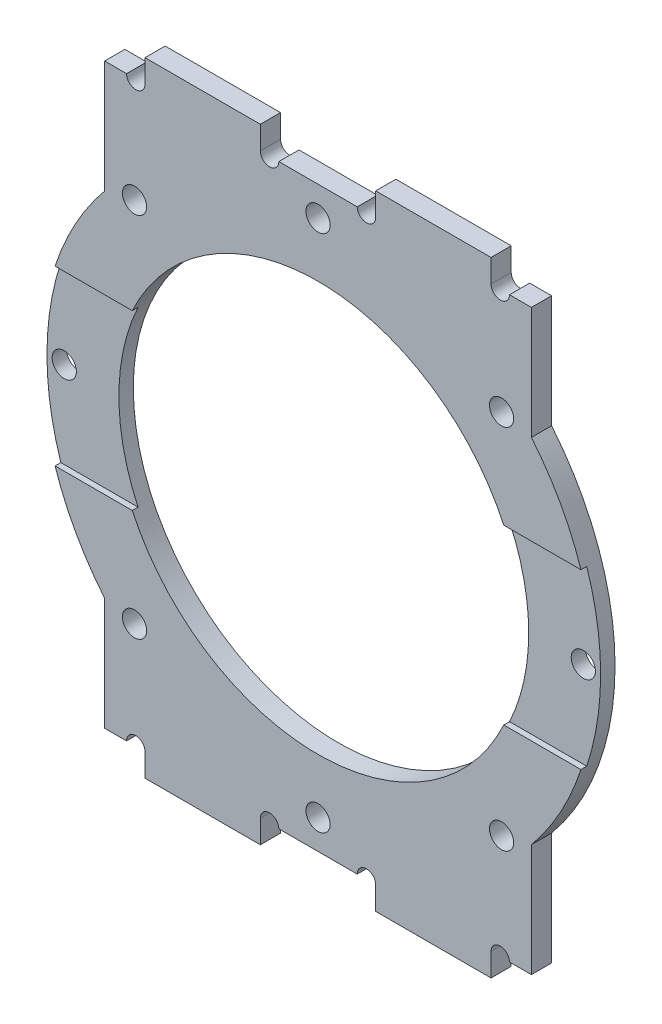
ISO-10303-21;
HEADER;
FILE_DESCRIPTION(('STEP AP214'),'2;1');
FILE_NAME('part.step','',(''),(''),'','','');
FILE_SCHEMA(('AUTOMOTIVE_DESIGN { 1 0 10303 214 1 1 1 1 }'));
ENDSEC;
DATA;
#1=APPLICATION_CONTEXT('core data for automotive mechanical design processes');
#2=APPLICATION_PROTOCOL_DEFINITION('international standard','automotive_design',2000,#1);
#3=PRODUCT_CONTEXT('',#1,'mechanical');
#4=PRODUCT('Part','Part','',(#3));
#5=PRODUCT_RELATED_PRODUCT_CATEGORY('part','',(#4));
#6=PRODUCT_DEFINITION_FORMATION('','',#4);
#7=PRODUCT_DEFINITION_CONTEXT('part definition',#1,'design');
#8=PRODUCT_DEFINITION('design','',#6,#7);
#9=PRODUCT_DEFINITION_SHAPE('','',#8);
#10=(LENGTH_UNIT() NAMED_UNIT(*) SI_UNIT(.MILLI.,.METRE.));
#11=(NAMED_UNIT(*) PLANE_ANGLE_UNIT() SI_UNIT($,.RADIAN.));
#12=(NAMED_UNIT(*) SI_UNIT($,.STERADIAN.) SOLID_ANGLE_UNIT());
#13=UNCERTAINTY_MEASURE_WITH_UNIT(LENGTH_MEASURE(1.E-05),#10,'distance_accuracy_value','');
#14=(GEOMETRIC_REPRESENTATION_CONTEXT(3) GLOBAL_UNCERTAINTY_ASSIGNED_CONTEXT((#13)) GLOBAL_UNIT_ASSIGNED_CONTEXT((#10,
#11,#12)) REPRESENTATION_CONTEXT('',''));
#15=CARTESIAN_POINT('',(0.,0.,0.));
#16=DIRECTION('',(0.,0.,1.));
#17=DIRECTION('',(1.,0.,0.));
#18=AXIS2_PLACEMENT_3D('',#15,#16,#17);
#19=CARTESIAN_POINT('',(0.,0.,2.5));
#20=DIRECTION('',(0.,0.,1.));
#21=DIRECTION('',(1.,0.,0.));
#22=AXIS2_PLACEMENT_3D('',#19,#20,#21);
#23=PLANE('',#22);
#24=CARTESIAN_POINT('',(-45.,0.,2.5));
#25=DIRECTION('',(0.,0.,1.));
#26=DIRECTION('',(1.,0.,0.));
#27=AXIS2_PLACEMENT_3D('',#24,#25,#26);
#28=CIRCLE('',#27,2.1);
#29=CARTESIAN_POINT('',(-42.9,0.,2.5));
#30=VERTEX_POINT('',#29);
#31=EDGE_CURVE('E810',#30,#30,#28,.T.);
#32=ORIENTED_EDGE('',*,*,#31,.F.);
#33=EDGE_LOOP('',(#32));
#34=FACE_BOUND('',#33,.T.);
#35=DIRECTION('',(-1.,0.,0.));
#36=VECTOR('',#35,1.);
#37=CARTESIAN_POINT('',(-55.,15.,2.5));
#38=LINE('',#37,#36);
#39=CARTESIAN_POINT('',(-32.2083979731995,15.,2.5));
#40=VERTEX_POINT('',#39);
#41=CARTESIAN_POINT('',(-45.596052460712,15.,2.5));
#42=VERTEX_POINT('',#41);
#43=EDGE_CURVE('E11',#40,#42,#38,.T.);
#44=ORIENTED_EDGE('',*,*,#43,.T.);
#45=CARTESIAN_POINT('',(0.,0.,2.5));
#46=DIRECTION('',(0.,0.,1.));
#47=DIRECTION('',(1.,0.,0.));
#48=AXIS2_PLACEMENT_3D('',#45,#46,#47);
#49=CIRCLE('',#48,48.);
#50=CARTESIAN_POINT('',(-45.596052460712,-15.,2.5));
#51=VERTEX_POINT('',#50);
#52=EDGE_CURVE('E643',#42,#51,#49,.T.);
#53=ORIENTED_EDGE('',*,*,#52,.T.);
#54=DIRECTION('',(1.,0.,0.));
#55=VECTOR('',#54,1.);
#56=CARTESIAN_POINT('',(-55.,-15.,2.5));
#57=LINE('',#56,#55);
#58=CARTESIAN_POINT('',(-32.2083979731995,-15.,2.5));
#59=VERTEX_POINT('',#58);
#60=EDGE_CURVE('E27',#51,#59,#57,.T.);
#61=ORIENTED_EDGE('',*,*,#60,.T.);
#62=CARTESIAN_POINT('',(0.,0.,2.5));
#63=DIRECTION('',(0.,0.,-1.));
#64=DIRECTION('',(1.,0.,0.));
#65=AXIS2_PLACEMENT_3D('',#62,#63,#64);
#66=CIRCLE('',#65,35.53);
#67=EDGE_CURVE('E40',#59,#40,#66,.T.);
#68=ORIENTED_EDGE('',*,*,#67,.T.);
#69=EDGE_LOOP('',(#44,#53,#61,#68));
#70=FACE_BOUND('',#69,.T.);
#71=ADVANCED_FACE('F17',(#34,#70),#23,.T.);
#72=CARTESIAN_POINT('',(-55.,15.,2.5));
#73=DIRECTION('',(0.,1.,0.));
#74=DIRECTION('',(1.,0.,0.));
#75=AXIS2_PLACEMENT_3D('',#72,#73,#74);
#76=PLANE('',#75);
#77=ORIENTED_EDGE('',*,*,#43,.F.);
#78=DIRECTION('',(0.,0.,-1.));
#79=VECTOR('',#78,1.);
#80=CARTESIAN_POINT('',(-32.2083979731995,15.,-26.5));
#81=LINE('',#80,#79);
#82=CARTESIAN_POINT('',(-32.2083979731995,15.,3.5));
#83=VERTEX_POINT('',#82);
#84=EDGE_CURVE('E627',#83,#40,#81,.T.);
#85=ORIENTED_EDGE('',*,*,#84,.F.);
#86=DIRECTION('',(-1.,0.,0.));
#87=VECTOR('',#86,1.);
#88=CARTESIAN_POINT('',(-55.,15.,3.5));
#89=LINE('',#88,#87);
#90=CARTESIAN_POINT('',(-45.596052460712,15.,3.5));
#91=VERTEX_POINT('',#90);
#92=EDGE_CURVE('E406',#83,#91,#89,.T.);
#93=ORIENTED_EDGE('',*,*,#92,.T.);
#94=DIRECTION('',(0.,0.,1.));
#95=VECTOR('',#94,1.);
#96=CARTESIAN_POINT('',(-45.596052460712,15.,3.5));
#97=LINE('',#96,#95);
#98=EDGE_CURVE('E578',#42,#91,#97,.T.);
#99=ORIENTED_EDGE('',*,*,#98,.F.);
#100=EDGE_LOOP('',(#77,#85,#93,#99));
#101=FACE_BOUND('',#100,.T.);
#102=ADVANCED_FACE('F19',(#101),#76,.F.);
#103=CARTESIAN_POINT('',(-55.,-15.,2.5));
#104=DIRECTION('',(0.,-1.,0.));
#105=DIRECTION('',(0.,0.,-1.));
#106=AXIS2_PLACEMENT_3D('',#103,#104,#105);
#107=PLANE('',#106);
#108=DIRECTION('',(1.,0.,0.));
#109=VECTOR('',#108,1.);
#110=CARTESIAN_POINT('',(-55.,-15.,3.5));
#111=LINE('',#110,#109);
#112=CARTESIAN_POINT('',(-45.596052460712,-15.,3.5));
#113=VERTEX_POINT('',#112);
#114=CARTESIAN_POINT('',(-32.2083979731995,-15.,3.5));
#115=VERTEX_POINT('',#114);
#116=EDGE_CURVE('E650',#113,#115,#111,.T.);
#117=ORIENTED_EDGE('',*,*,#116,.T.);
#118=DIRECTION('',(0.,0.,1.));
#119=VECTOR('',#118,1.);
#120=CARTESIAN_POINT('',(-32.2083979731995,-15.,-26.5));
#121=LINE('',#120,#119);
#122=EDGE_CURVE('E648',#59,#115,#121,.T.);
#123=ORIENTED_EDGE('',*,*,#122,.F.);
#124=ORIENTED_EDGE('',*,*,#60,.F.);
#125=DIRECTION('',(0.,0.,-1.));
#126=VECTOR('',#125,1.);
#127=CARTESIAN_POINT('',(-45.596052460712,-15.,3.5));
#128=LINE('',#127,#126);
#129=EDGE_CURVE('E799',#113,#51,#128,.T.);
#130=ORIENTED_EDGE('',*,*,#129,.F.);
#131=EDGE_LOOP('',(#117,#123,#124,#130));
#132=FACE_BOUND('',#131,.T.);
#133=ADVANCED_FACE('F649',(#132),#107,.F.);
#134=CARTESIAN_POINT('',(-55.,-15.,2.5));
#135=DIRECTION('',(0.,-1.,0.));
#136=DIRECTION('',(0.,0.,-1.));
#137=AXIS2_PLACEMENT_3D('',#134,#135,#136);
#138=PLANE('',#137);
#139=DIRECTION('',(1.,0.,0.));
#140=VECTOR('',#139,1.);
#141=CARTESIAN_POINT('',(-55.,-15.,2.5));
#142=LINE('',#141,#140);
#143=CARTESIAN_POINT('',(32.2083979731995,-15.,2.5));
#144=VERTEX_POINT('',#143);
#145=CARTESIAN_POINT('',(45.596052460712,-15.,2.5));
#146=VERTEX_POINT('',#145);
#147=EDGE_CURVE('E636',#144,#146,#142,.T.);
#148=ORIENTED_EDGE('',*,*,#147,.F.);
#149=DIRECTION('',(0.,0.,-1.));
#150=VECTOR('',#149,1.);
#151=CARTESIAN_POINT('',(32.2083979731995,-15.,-26.5));
#152=LINE('',#151,#150);
#153=CARTESIAN_POINT('',(32.2083979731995,-15.,3.5));
#154=VERTEX_POINT('',#153);
#155=EDGE_CURVE('E690',#154,#144,#152,.T.);
#156=ORIENTED_EDGE('',*,*,#155,.F.);
#157=DIRECTION('',(1.,0.,0.));
#158=VECTOR('',#157,1.);
#159=CARTESIAN_POINT('',(-55.,-15.,3.5));
#160=LINE('',#159,#158);
#161=CARTESIAN_POINT('',(45.596052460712,-15.,3.5));
#162=VERTEX_POINT('',#161);
#163=EDGE_CURVE('E414',#154,#162,#160,.T.);
#164=ORIENTED_EDGE('',*,*,#163,.T.);
#165=DIRECTION('',(0.,0.,1.));
#166=VECTOR('',#165,1.);
#167=CARTESIAN_POINT('',(45.596052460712,-15.,3.5));
#168=LINE('',#167,#166);
#169=EDGE_CURVE('E435',#146,#162,#168,.T.);
#170=ORIENTED_EDGE('',*,*,#169,.F.);
#171=EDGE_LOOP('',(#148,#156,#164,#170));
#172=FACE_BOUND('',#171,.T.);
#173=ADVANCED_FACE('F901',(#172),#138,.F.);
#174=CARTESIAN_POINT('',(-55.,15.,2.5));
#175=DIRECTION('',(0.,1.,0.));
#176=DIRECTION('',(1.,0.,0.));
#177=AXIS2_PLACEMENT_3D('',#174,#175,#176);
#178=PLANE('',#177);
#179=DIRECTION('',(-1.,0.,0.));
#180=VECTOR('',#179,1.);
#181=CARTESIAN_POINT('',(-55.,15.,3.5));
#182=LINE('',#181,#180);
#183=CARTESIAN_POINT('',(45.596052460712,15.,3.5));
#184=VERTEX_POINT('',#183);
#185=CARTESIAN_POINT('',(32.2083979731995,15.,3.5));
#186=VERTEX_POINT('',#185);
#187=EDGE_CURVE('E475',#184,#186,#182,.T.);
#188=ORIENTED_EDGE('',*,*,#187,.T.);
#189=DIRECTION('',(0.,0.,1.));
#190=VECTOR('',#189,1.);
#191=CARTESIAN_POINT('',(32.2083979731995,15.,-26.5));
#192=LINE('',#191,#190);
#193=CARTESIAN_POINT('',(32.2083979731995,15.,2.5));
#194=VERTEX_POINT('',#193);
#195=EDGE_CURVE('E632',#194,#186,#192,.T.);
#196=ORIENTED_EDGE('',*,*,#195,.F.);
#197=DIRECTION('',(-1.,0.,0.));
#198=VECTOR('',#197,1.);
#199=CARTESIAN_POINT('',(-55.,15.,2.5));
#200=LINE('',#199,#198);
#201=CARTESIAN_POINT('',(45.596052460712,15.,2.5));
#202=VERTEX_POINT('',#201);
#203=EDGE_CURVE('E631',#202,#194,#200,.T.);
#204=ORIENTED_EDGE('',*,*,#203,.F.);
#205=DIRECTION('',(0.,0.,-1.));
#206=VECTOR('',#205,1.);
#207=CARTESIAN_POINT('',(45.596052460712,15.,3.5));
#208=LINE('',#207,#206);
#209=EDGE_CURVE('E495',#184,#202,#208,.T.);
#210=ORIENTED_EDGE('',*,*,#209,.F.);
#211=EDGE_LOOP('',(#188,#196,#204,#210));
#212=FACE_BOUND('',#211,.T.);
#213=ADVANCED_FACE('F908',(#212),#178,.F.);
#214=CARTESIAN_POINT('',(0.,0.,2.5));
#215=DIRECTION('',(0.,0.,1.));
#216=DIRECTION('',(1.,0.,0.));
#217=AXIS2_PLACEMENT_3D('',#214,#215,#216);
#218=PLANE('',#217);
#219=CARTESIAN_POINT('',(45.,0.,2.5));
#220=DIRECTION('',(0.,0.,1.));
#221=DIRECTION('',(1.,0.,0.));
#222=AXIS2_PLACEMENT_3D('',#219,#220,#221);
#223=CIRCLE('',#222,2.1);
#224=CARTESIAN_POINT('',(47.1,0.,2.5));
#225=VERTEX_POINT('',#224);
#226=EDGE_CURVE('E804',#225,#225,#223,.T.);
#227=ORIENTED_EDGE('',*,*,#226,.F.);
#228=EDGE_LOOP('',(#227));
#229=FACE_BOUND('',#228,.T.);
#230=CARTESIAN_POINT('',(0.,0.,2.5));
#231=DIRECTION('',(0.,0.,1.));
#232=DIRECTION('',(1.,0.,0.));
#233=AXIS2_PLACEMENT_3D('',#230,#231,#232);
#234=CIRCLE('',#233,48.);
#235=EDGE_CURVE('E431',#146,#202,#234,.T.);
#236=ORIENTED_EDGE('',*,*,#235,.T.);
#237=ORIENTED_EDGE('',*,*,#203,.T.);
#238=CARTESIAN_POINT('',(0.,0.,2.5));
#239=DIRECTION('',(0.,0.,-1.));
#240=DIRECTION('',(1.,0.,0.));
#241=AXIS2_PLACEMENT_3D('',#238,#239,#240);
#242=CIRCLE('',#241,35.53);
#243=EDGE_CURVE('E681',#194,#144,#242,.T.);
#244=ORIENTED_EDGE('',*,*,#243,.T.);
#245=ORIENTED_EDGE('',*,*,#147,.T.);
#246=EDGE_LOOP('',(#236,#237,#244,#245));
#247=FACE_BOUND('',#246,.T.);
#248=ADVANCED_FACE('F905',(#229,#247),#218,.T.);
#249=CARTESIAN_POINT('',(-31.6,-50.1,-10.5));
#250=DIRECTION('',(0.,0.,1.));
#251=DIRECTION('',(1.,0.,0.));
#252=AXIS2_PLACEMENT_3D('',#249,#250,#251);
#253=CYLINDRICAL_SURFACE('',#252,1.6);
#254=CARTESIAN_POINT('',(-31.6,-50.1,0.));
#255=DIRECTION('',(0.,0.,-1.));
#256=DIRECTION('',(1.,0.,0.));
#257=AXIS2_PLACEMENT_3D('',#254,#255,#256);
#258=CIRCLE('',#257,1.6);
#259=CARTESIAN_POINT('',(-33.2,-50.1,0.));
#260=VERTEX_POINT('',#259);
#261=CARTESIAN_POINT('',(-30.,-50.1,0.));
#262=VERTEX_POINT('',#261);
#263=EDGE_CURVE('E405',#260,#262,#258,.T.);
#264=ORIENTED_EDGE('',*,*,#263,.T.);
#265=DIRECTION('',(0.,0.,1.));
#266=VECTOR('',#265,1.);
#267=CARTESIAN_POINT('',(-30.,-50.1,0.));
#268=LINE('',#267,#266);
#269=CARTESIAN_POINT('',(-30.,-50.1,3.5));
#270=VERTEX_POINT('',#269);
#271=EDGE_CURVE('E525',#262,#270,#268,.T.);
#272=ORIENTED_EDGE('',*,*,#271,.T.);
#273=CARTESIAN_POINT('',(-31.6,-50.1,3.5));
#274=DIRECTION('',(0.,0.,-1.));
#275=DIRECTION('',(1.,0.,0.));
#276=AXIS2_PLACEMENT_3D('',#273,#274,#275);
#277=CIRCLE('',#276,1.6);
#278=CARTESIAN_POINT('',(-33.2,-50.1,3.5));
#279=VERTEX_POINT('',#278);
#280=EDGE_CURVE('E766',#279,#270,#277,.T.);
#281=ORIENTED_EDGE('',*,*,#280,.F.);
#282=DIRECTION('',(0.,0.,1.));
#283=VECTOR('',#282,1.);
#284=CARTESIAN_POINT('',(-33.2,-50.1,-10.5));
#285=LINE('',#284,#283);
#286=EDGE_CURVE('E460',#260,#279,#285,.T.);
#287=ORIENTED_EDGE('',*,*,#286,.F.);
#288=EDGE_LOOP('',(#264,#272,#281,#287));
#289=FACE_BOUND('',#288,.T.);
#290=ADVANCED_FACE('F933',(#289),#253,.F.);
#291=CARTESIAN_POINT('',(-8.4,-50.1,-10.5));
#292=DIRECTION('',(0.,0.,1.));
#293=DIRECTION('',(1.,0.,0.));
#294=AXIS2_PLACEMENT_3D('',#291,#292,#293);
#295=CYLINDRICAL_SURFACE('',#294,1.6);
#296=CARTESIAN_POINT('',(-8.4,-50.1,3.5));
#297=DIRECTION('',(0.,0.,-1.));
#298=DIRECTION('',(1.,0.,0.));
#299=AXIS2_PLACEMENT_3D('',#296,#297,#298);
#300=CIRCLE('',#299,1.6);
#301=CARTESIAN_POINT('',(-10.,-50.1,3.5));
#302=VERTEX_POINT('',#301);
#303=CARTESIAN_POINT('',(-6.8,-50.1,3.5));
#304=VERTEX_POINT('',#303);
#305=EDGE_CURVE('E713',#302,#304,#300,.T.);
#306=ORIENTED_EDGE('',*,*,#305,.F.);
#307=DIRECTION('',(0.,0.,1.));
#308=VECTOR('',#307,1.);
#309=CARTESIAN_POINT('',(-10.,-50.1,0.));
#310=LINE('',#309,#308);
#311=CARTESIAN_POINT('',(-10.,-50.1,0.));
#312=VERTEX_POINT('',#311);
#313=EDGE_CURVE('E619',#312,#302,#310,.T.);
#314=ORIENTED_EDGE('',*,*,#313,.F.);
#315=CARTESIAN_POINT('',(-8.4,-50.1,0.));
#316=DIRECTION('',(0.,0.,-1.));
#317=DIRECTION('',(1.,0.,0.));
#318=AXIS2_PLACEMENT_3D('',#315,#316,#317);
#319=CIRCLE('',#318,1.6);
#320=CARTESIAN_POINT('',(-6.8,-50.1,0.));
#321=VERTEX_POINT('',#320);
#322=EDGE_CURVE('E563',#312,#321,#319,.T.);
#323=ORIENTED_EDGE('',*,*,#322,.T.);
#324=DIRECTION('',(0.,0.,-1.));
#325=VECTOR('',#324,1.);
#326=CARTESIAN_POINT('',(-6.8,-50.1,-10.5));
#327=LINE('',#326,#325);
#328=EDGE_CURVE('E445',#304,#321,#327,.T.);
#329=ORIENTED_EDGE('',*,*,#328,.F.);
#330=EDGE_LOOP('',(#306,#314,#323,#329));
#331=FACE_BOUND('',#330,.T.);
#332=ADVANCED_FACE('F949',(#331),#295,.F.);
#333=CARTESIAN_POINT('',(31.6,-50.1,-10.5));
#334=DIRECTION('',(0.,0.,1.));
#335=DIRECTION('',(1.,0.,0.));
#336=AXIS2_PLACEMENT_3D('',#333,#334,#335);
#337=CYLINDRICAL_SURFACE('',#336,1.6);
#338=CARTESIAN_POINT('',(31.6,-50.1,3.5));
#339=DIRECTION('',(0.,0.,-1.));
#340=DIRECTION('',(1.,0.,0.));
#341=AXIS2_PLACEMENT_3D('',#338,#339,#340);
#342=CIRCLE('',#341,1.6);
#343=CARTESIAN_POINT('',(30.,-50.1,3.5));
#344=VERTEX_POINT('',#343);
#345=CARTESIAN_POINT('',(33.2,-50.1,3.5));
#346=VERTEX_POINT('',#345);
#347=EDGE_CURVE('E360',#344,#346,#342,.T.);
#348=ORIENTED_EDGE('',*,*,#347,.F.);
#349=DIRECTION('',(0.,0.,1.));
#350=VECTOR('',#349,1.);
#351=CARTESIAN_POINT('',(30.,-50.1,0.));
#352=LINE('',#351,#350);
#353=CARTESIAN_POINT('',(30.,-50.1,0.));
#354=VERTEX_POINT('',#353);
#355=EDGE_CURVE('E353',#354,#344,#352,.T.);
#356=ORIENTED_EDGE('',*,*,#355,.F.);
#357=CARTESIAN_POINT('',(31.6,-50.1,0.));
#358=DIRECTION('',(0.,0.,-1.));
#359=DIRECTION('',(1.,0.,0.));
#360=AXIS2_PLACEMENT_3D('',#357,#358,#359);
#361=CIRCLE('',#360,1.6);
#362=CARTESIAN_POINT('',(33.2,-50.1,0.));
#363=VERTEX_POINT('',#362);
#364=EDGE_CURVE('E357',#354,#363,#361,.T.);
#365=ORIENTED_EDGE('',*,*,#364,.T.);
#366=DIRECTION('',(0.,0.,-1.));
#367=VECTOR('',#366,1.);
#368=CARTESIAN_POINT('',(33.2,-50.1,-10.5));
#369=LINE('',#368,#367);
#370=EDGE_CURVE('E437',#346,#363,#369,.T.);
#371=ORIENTED_EDGE('',*,*,#370,.F.);
#372=EDGE_LOOP('',(#348,#356,#365,#371));
#373=FACE_BOUND('',#372,.T.);
#374=ADVANCED_FACE('F355',(#373),#337,.F.);
#375=CARTESIAN_POINT('',(8.4,-50.1,-10.5));
#376=DIRECTION('',(0.,0.,1.));
#377=DIRECTION('',(1.,0.,0.));
#378=AXIS2_PLACEMENT_3D('',#375,#376,#377);
#379=CYLINDRICAL_SURFACE('',#378,1.6);
#380=CARTESIAN_POINT('',(8.4,-50.1,0.));
#381=DIRECTION('',(0.,0.,-1.));
#382=DIRECTION('',(1.,0.,0.));
#383=AXIS2_PLACEMENT_3D('',#380,#381,#382);
#384=CIRCLE('',#383,1.6);
#385=CARTESIAN_POINT('',(6.8,-50.1,0.));
#386=VERTEX_POINT('',#385);
#387=CARTESIAN_POINT('',(10.,-50.1,0.));
#388=VERTEX_POINT('',#387);
#389=EDGE_CURVE('E559',#386,#388,#384,.T.);
#390=ORIENTED_EDGE('',*,*,#389,.T.);
#391=DIRECTION('',(0.,0.,1.));
#392=VECTOR('',#391,1.);
#393=CARTESIAN_POINT('',(10.,-50.1,0.));
#394=LINE('',#393,#392);
#395=CARTESIAN_POINT('',(10.,-50.1,3.5));
#396=VERTEX_POINT('',#395);
#397=EDGE_CURVE('E626',#388,#396,#394,.T.);
#398=ORIENTED_EDGE('',*,*,#397,.T.);
#399=CARTESIAN_POINT('',(8.4,-50.1,3.5));
#400=DIRECTION('',(0.,0.,-1.));
#401=DIRECTION('',(1.,0.,0.));
#402=AXIS2_PLACEMENT_3D('',#399,#400,#401);
#403=CIRCLE('',#402,1.6);
#404=CARTESIAN_POINT('',(6.8,-50.1,3.5));
#405=VERTEX_POINT('',#404);
#406=EDGE_CURVE('E712',#405,#396,#403,.T.);
#407=ORIENTED_EDGE('',*,*,#406,.F.);
#408=DIRECTION('',(0.,0.,1.));
#409=VECTOR('',#408,1.);
#410=CARTESIAN_POINT('',(6.8,-50.1,-10.5));
#411=LINE('',#410,#409);
#412=EDGE_CURVE('E456',#386,#405,#411,.T.);
#413=ORIENTED_EDGE('',*,*,#412,.F.);
#414=EDGE_LOOP('',(#390,#398,#407,#413));
#415=FACE_BOUND('',#414,.T.);
#416=ADVANCED_FACE('F871',(#415),#379,.F.);
#417=CARTESIAN_POINT('',(10.,-50.1,0.));
#418=DIRECTION('',(1.,0.,0.));
#419=DIRECTION('',(0.,-1.,0.));
#420=AXIS2_PLACEMENT_3D('',#417,#418,#419);
#421=PLANE('',#420);
#422=DIRECTION('',(0.,1.,0.));
#423=VECTOR('',#422,1.);
#424=CARTESIAN_POINT('',(10.,-50.1,3.5));
#425=LINE('',#424,#423);
#426=CARTESIAN_POINT('',(10.,-54.1,3.5));
#427=VERTEX_POINT('',#426);
#428=EDGE_CURVE('E726',#427,#396,#425,.T.);
#429=ORIENTED_EDGE('',*,*,#428,.T.);
#430=ORIENTED_EDGE('',*,*,#397,.F.);
#431=DIRECTION('',(0.,1.,0.));
#432=VECTOR('',#431,1.);
#433=CARTESIAN_POINT('',(10.,-50.1,0.));
#434=LINE('',#433,#432);
#435=CARTESIAN_POINT('',(10.,-54.1,0.));
#436=VERTEX_POINT('',#435);
#437=EDGE_CURVE('E555',#436,#388,#434,.T.);
#438=ORIENTED_EDGE('',*,*,#437,.F.);
#439=DIRECTION('',(0.,0.,1.));
#440=VECTOR('',#439,1.);
#441=CARTESIAN_POINT('',(10.,-54.1,0.));
#442=LINE('',#441,#440);
#443=EDGE_CURVE('E365',#436,#427,#442,.T.);
#444=ORIENTED_EDGE('',*,*,#443,.T.);
#445=EDGE_LOOP('',(#429,#430,#438,#444));
#446=FACE_BOUND('',#445,.T.);
#447=ADVANCED_FACE('F875',(#446),#421,.F.);
#448=CARTESIAN_POINT('',(30.,-54.1,0.));
#449=DIRECTION('',(0.,1.,0.));
#450=DIRECTION('',(1.,0.,0.));
#451=AXIS2_PLACEMENT_3D('',#448,#449,#450);
#452=PLANE('',#451);
#453=DIRECTION('',(-1.,0.,0.));
#454=VECTOR('',#453,1.);
#455=CARTESIAN_POINT('',(30.,-54.1,3.5));
#456=LINE('',#455,#454);
#457=CARTESIAN_POINT('',(30.,-54.1,3.5));
#458=VERTEX_POINT('',#457);
#459=EDGE_CURVE('E670',#458,#427,#456,.T.);
#460=ORIENTED_EDGE('',*,*,#459,.T.);
#461=ORIENTED_EDGE('',*,*,#443,.F.);
#462=DIRECTION('',(-1.,0.,0.));
#463=VECTOR('',#462,1.);
#464=CARTESIAN_POINT('',(30.,-54.1,0.));
#465=LINE('',#464,#463);
#466=CARTESIAN_POINT('',(30.,-54.1,0.));
#467=VERTEX_POINT('',#466);
#468=EDGE_CURVE('E375',#467,#436,#465,.T.);
#469=ORIENTED_EDGE('',*,*,#468,.F.);
#470=DIRECTION('',(0.,0.,1.));
#471=VECTOR('',#470,1.);
#472=CARTESIAN_POINT('',(30.,-54.1,0.));
#473=LINE('',#472,#471);
#474=EDGE_CURVE('E366',#467,#458,#473,.T.);
#475=ORIENTED_EDGE('',*,*,#474,.T.);
#476=EDGE_LOOP('',(#460,#461,#469,#475));
#477=FACE_BOUND('',#476,.T.);
#478=ADVANCED_FACE('F878',(#477),#452,.F.);
#479=CARTESIAN_POINT('',(30.,-50.1,0.));
#480=DIRECTION('',(-1.,0.,0.));
#481=DIRECTION('',(0.,0.,1.));
#482=AXIS2_PLACEMENT_3D('',#479,#480,#481);
#483=PLANE('',#482);
#484=DIRECTION('',(0.,-1.,0.));
#485=VECTOR('',#484,1.);
#486=CARTESIAN_POINT('',(30.,-50.1,3.5));
#487=LINE('',#486,#485);
#488=EDGE_CURVE('E392',#344,#458,#487,.T.);
#489=ORIENTED_EDGE('',*,*,#488,.T.);
#490=ORIENTED_EDGE('',*,*,#474,.F.);
#491=DIRECTION('',(0.,-1.,0.));
#492=VECTOR('',#491,1.);
#493=CARTESIAN_POINT('',(30.,-50.1,0.));
#494=LINE('',#493,#492);
#495=EDGE_CURVE('E369',#354,#467,#494,.T.);
#496=ORIENTED_EDGE('',*,*,#495,.F.);
#497=ORIENTED_EDGE('',*,*,#355,.T.);
#498=EDGE_LOOP('',(#489,#490,#496,#497));
#499=FACE_BOUND('',#498,.T.);
#500=ADVANCED_FACE('F370',(#499),#483,.F.);
#501=CARTESIAN_POINT('',(-30.,-54.1,0.));
#502=DIRECTION('',(0.,1.,0.));
#503=DIRECTION('',(1.,0.,0.));
#504=AXIS2_PLACEMENT_3D('',#501,#502,#503);
#505=PLANE('',#504);
#506=DIRECTION('',(-1.,0.,0.));
#507=VECTOR('',#506,1.);
#508=CARTESIAN_POINT('',(-30.,-54.1,3.5));
#509=LINE('',#508,#507);
#510=CARTESIAN_POINT('',(-10.,-54.1,3.5));
#511=VERTEX_POINT('',#510);
#512=CARTESIAN_POINT('',(-30.,-54.1,3.5));
#513=VERTEX_POINT('',#512);
#514=EDGE_CURVE('E747',#511,#513,#509,.T.);
#515=ORIENTED_EDGE('',*,*,#514,.T.);
#516=DIRECTION('',(0.,0.,1.));
#517=VECTOR('',#516,1.);
#518=CARTESIAN_POINT('',(-30.,-54.1,0.));
#519=LINE('',#518,#517);
#520=CARTESIAN_POINT('',(-30.,-54.1,0.));
#521=VERTEX_POINT('',#520);
#522=EDGE_CURVE('E521',#521,#513,#519,.T.);
#523=ORIENTED_EDGE('',*,*,#522,.F.);
#524=DIRECTION('',(-1.,0.,0.));
#525=VECTOR('',#524,1.);
#526=CARTESIAN_POINT('',(-30.,-54.1,0.));
#527=LINE('',#526,#525);
#528=CARTESIAN_POINT('',(-10.,-54.1,0.));
#529=VERTEX_POINT('',#528);
#530=EDGE_CURVE('E570',#529,#521,#527,.T.);
#531=ORIENTED_EDGE('',*,*,#530,.F.);
#532=DIRECTION('',(0.,0.,1.));
#533=VECTOR('',#532,1.);
#534=CARTESIAN_POINT('',(-10.,-54.1,0.));
#535=LINE('',#534,#533);
#536=EDGE_CURVE('E524',#529,#511,#535,.T.);
#537=ORIENTED_EDGE('',*,*,#536,.T.);
#538=EDGE_LOOP('',(#515,#523,#531,#537));
#539=FACE_BOUND('',#538,.T.);
#540=ADVANCED_FACE('F942',(#539),#505,.F.);
#541=CARTESIAN_POINT('',(-10.,-50.1,0.));
#542=DIRECTION('',(-1.,0.,0.));
#543=DIRECTION('',(0.,1.,0.));
#544=AXIS2_PLACEMENT_3D('',#541,#542,#543);
#545=PLANE('',#544);
#546=DIRECTION('',(0.,-1.,0.));
#547=VECTOR('',#546,1.);
#548=CARTESIAN_POINT('',(-10.,-50.1,3.5));
#549=LINE('',#548,#547);
#550=EDGE_CURVE('E743',#302,#511,#549,.T.);
#551=ORIENTED_EDGE('',*,*,#550,.T.);
#552=ORIENTED_EDGE('',*,*,#536,.F.);
#553=DIRECTION('',(0.,-1.,0.));
#554=VECTOR('',#553,1.);
#555=CARTESIAN_POINT('',(-10.,-50.1,0.));
#556=LINE('',#555,#554);
#557=EDGE_CURVE('E566',#312,#529,#556,.T.);
#558=ORIENTED_EDGE('',*,*,#557,.F.);
#559=ORIENTED_EDGE('',*,*,#313,.T.);
#560=EDGE_LOOP('',(#551,#552,#558,#559));
#561=FACE_BOUND('',#560,.T.);
#562=ADVANCED_FACE('F946',(#561),#545,.F.);
#563=CARTESIAN_POINT('',(-30.,-50.1,0.));
#564=DIRECTION('',(1.,0.,0.));
#565=DIRECTION('',(0.,1.,0.));
#566=AXIS2_PLACEMENT_3D('',#563,#564,#565);
#567=PLANE('',#566);
#568=DIRECTION('',(0.,1.,0.));
#569=VECTOR('',#568,1.);
#570=CARTESIAN_POINT('',(-30.,-50.1,3.5));
#571=LINE('',#570,#569);
#572=EDGE_CURVE('E770',#513,#270,#571,.T.);
#573=ORIENTED_EDGE('',*,*,#572,.T.);
#574=ORIENTED_EDGE('',*,*,#271,.F.);
#575=DIRECTION('',(0.,1.,0.));
#576=VECTOR('',#575,1.);
#577=CARTESIAN_POINT('',(-30.,-50.1,0.));
#578=LINE('',#577,#576);
#579=EDGE_CURVE('E574',#521,#262,#578,.T.);
#580=ORIENTED_EDGE('',*,*,#579,.F.);
#581=ORIENTED_EDGE('',*,*,#522,.T.);
#582=EDGE_LOOP('',(#573,#574,#580,#581));
#583=FACE_BOUND('',#582,.T.);
#584=ADVANCED_FACE('F938',(#583),#567,.F.);
#585=CARTESIAN_POINT('',(-31.6,50.1,-10.5));
#586=DIRECTION('',(0.,0.,1.));
#587=DIRECTION('',(1.,0.,0.));
#588=AXIS2_PLACEMENT_3D('',#585,#586,#587);
#589=CYLINDRICAL_SURFACE('',#588,1.6);
#590=CARTESIAN_POINT('',(-31.6,50.1,3.5));
#591=DIRECTION('',(0.,0.,1.));
#592=DIRECTION('',(1.,0.,0.));
#593=AXIS2_PLACEMENT_3D('',#590,#591,#592);
#594=CIRCLE('',#593,1.6);
#595=CARTESIAN_POINT('',(-33.2,50.1,3.5));
#596=VERTEX_POINT('',#595);
#597=CARTESIAN_POINT('',(-30.,50.1,3.5));
#598=VERTEX_POINT('',#597);
#599=EDGE_CURVE('E759',#596,#598,#594,.T.);
#600=ORIENTED_EDGE('',*,*,#599,.T.);
#601=DIRECTION('',(0.,0.,1.));
#602=VECTOR('',#601,1.);
#603=CARTESIAN_POINT('',(-30.,50.1,0.));
#604=LINE('',#603,#602);
#605=CARTESIAN_POINT('',(-30.,50.1,0.));
#606=VERTEX_POINT('',#605);
#607=EDGE_CURVE('E594',#606,#598,#604,.T.);
#608=ORIENTED_EDGE('',*,*,#607,.F.);
#609=CARTESIAN_POINT('',(-31.6,50.1,0.));
#610=DIRECTION('',(0.,0.,1.));
#611=DIRECTION('',(1.,0.,0.));
#612=AXIS2_PLACEMENT_3D('',#609,#610,#611);
#613=CIRCLE('',#612,1.6);
#614=CARTESIAN_POINT('',(-33.2,50.1,0.));
#615=VERTEX_POINT('',#614);
#616=EDGE_CURVE('E534',#615,#606,#613,.T.);
#617=ORIENTED_EDGE('',*,*,#616,.F.);
#618=DIRECTION('',(0.,0.,-1.));
#619=VECTOR('',#618,1.);
#620=CARTESIAN_POINT('',(-33.2,50.1,-10.5));
#621=LINE('',#620,#619);
#622=EDGE_CURVE('E479',#596,#615,#621,.T.);
#623=ORIENTED_EDGE('',*,*,#622,.F.);
#624=EDGE_LOOP('',(#600,#608,#617,#623));
#625=FACE_BOUND('',#624,.T.);
#626=ADVANCED_FACE('F1803',(#625),#589,.F.);
#627=CARTESIAN_POINT('',(-8.4,50.1,-10.5));
#628=DIRECTION('',(0.,0.,1.));
#629=DIRECTION('',(1.,0.,0.));
#630=AXIS2_PLACEMENT_3D('',#627,#628,#629);
#631=CYLINDRICAL_SURFACE('',#630,1.6);
#632=CARTESIAN_POINT('',(-8.4,50.1,0.));
#633=DIRECTION('',(0.,0.,1.));
#634=DIRECTION('',(1.,0.,0.));
#635=AXIS2_PLACEMENT_3D('',#632,#633,#634);
#636=CIRCLE('',#635,1.6);
#637=CARTESIAN_POINT('',(-10.,50.1,0.));
#638=VERTEX_POINT('',#637);
#639=CARTESIAN_POINT('',(-6.8,50.1,0.));
#640=VERTEX_POINT('',#639);
#641=EDGE_CURVE('E419',#638,#640,#636,.T.);
#642=ORIENTED_EDGE('',*,*,#641,.F.);
#643=DIRECTION('',(0.,0.,1.));
#644=VECTOR('',#643,1.);
#645=CARTESIAN_POINT('',(-10.,50.1,0.));
#646=LINE('',#645,#644);
#647=CARTESIAN_POINT('',(-10.,50.1,3.5));
#648=VERTEX_POINT('',#647);
#649=EDGE_CURVE('E600',#638,#648,#646,.T.);
#650=ORIENTED_EDGE('',*,*,#649,.T.);
#651=CARTESIAN_POINT('',(-8.4,50.1,3.5));
#652=DIRECTION('',(0.,0.,1.));
#653=DIRECTION('',(1.,0.,0.));
#654=AXIS2_PLACEMENT_3D('',#651,#652,#653);
#655=CIRCLE('',#654,1.6);
#656=CARTESIAN_POINT('',(-6.8,50.1,3.5));
#657=VERTEX_POINT('',#656);
#658=EDGE_CURVE('E511',#648,#657,#655,.T.);
#659=ORIENTED_EDGE('',*,*,#658,.T.);
#660=DIRECTION('',(0.,0.,1.));
#661=VECTOR('',#660,1.);
#662=CARTESIAN_POINT('',(-6.8,50.1,-10.5));
#663=LINE('',#662,#661);
#664=EDGE_CURVE('E470',#640,#657,#663,.T.);
#665=ORIENTED_EDGE('',*,*,#664,.F.);
#666=EDGE_LOOP('',(#642,#650,#659,#665));
#667=FACE_BOUND('',#666,.T.);
#668=ADVANCED_FACE('F1973',(#667),#631,.F.);
#669=CARTESIAN_POINT('',(8.4,50.1,-10.5));
#670=DIRECTION('',(0.,0.,1.));
#671=DIRECTION('',(1.,0.,0.));
#672=AXIS2_PLACEMENT_3D('',#669,#670,#671);
#673=CYLINDRICAL_SURFACE('',#672,1.6);
#674=CARTESIAN_POINT('',(8.4,50.1,3.5));
#675=DIRECTION('',(0.,0.,1.));
#676=DIRECTION('',(1.,0.,0.));
#677=AXIS2_PLACEMENT_3D('',#674,#675,#676);
#678=CIRCLE('',#677,1.6);
#679=CARTESIAN_POINT('',(6.8,50.1,3.5));
#680=VERTEX_POINT('',#679);
#681=CARTESIAN_POINT('',(10.,50.1,3.5));
#682=VERTEX_POINT('',#681);
#683=EDGE_CURVE('E425',#680,#682,#678,.T.);
#684=ORIENTED_EDGE('',*,*,#683,.T.);
#685=DIRECTION('',(0.,0.,1.));
#686=VECTOR('',#685,1.);
#687=CARTESIAN_POINT('',(10.,50.1,0.));
#688=LINE('',#687,#686);
#689=CARTESIAN_POINT('',(10.,50.1,0.));
#690=VERTEX_POINT('',#689);
#691=EDGE_CURVE('E606',#690,#682,#688,.T.);
#692=ORIENTED_EDGE('',*,*,#691,.F.);
#693=CARTESIAN_POINT('',(8.4,50.1,0.));
#694=DIRECTION('',(0.,0.,1.));
#695=DIRECTION('',(1.,0.,0.));
#696=AXIS2_PLACEMENT_3D('',#693,#694,#695);
#697=CIRCLE('',#696,1.6);
#698=CARTESIAN_POINT('',(6.8,50.1,0.));
#699=VERTEX_POINT('',#698);
#700=EDGE_CURVE('E537',#699,#690,#697,.T.);
#701=ORIENTED_EDGE('',*,*,#700,.F.);
#702=DIRECTION('',(0.,0.,-1.));
#703=VECTOR('',#702,1.);
#704=CARTESIAN_POINT('',(6.8,50.1,-10.5));
#705=LINE('',#704,#703);
#706=EDGE_CURVE('E450',#680,#699,#705,.T.);
#707=ORIENTED_EDGE('',*,*,#706,.F.);
#708=EDGE_LOOP('',(#684,#692,#701,#707));
#709=FACE_BOUND('',#708,.T.);
#710=ADVANCED_FACE('F1964',(#709),#673,.F.);
#711=CARTESIAN_POINT('',(31.6,50.1,-10.5));
#712=DIRECTION('',(0.,0.,1.));
#713=DIRECTION('',(1.,0.,0.));
#714=AXIS2_PLACEMENT_3D('',#711,#712,#713);
#715=CYLINDRICAL_SURFACE('',#714,1.6);
#716=CARTESIAN_POINT('',(31.6,50.1,0.));
#717=DIRECTION('',(0.,0.,1.));
#718=DIRECTION('',(1.,0.,0.));
#719=AXIS2_PLACEMENT_3D('',#716,#717,#718);
#720=CIRCLE('',#719,1.6);
#721=CARTESIAN_POINT('',(30.,50.1,0.));
#722=VERTEX_POINT('',#721);
#723=CARTESIAN_POINT('',(33.2,50.1,0.));
#724=VERTEX_POINT('',#723);
#725=EDGE_CURVE('E542',#722,#724,#720,.T.);
#726=ORIENTED_EDGE('',*,*,#725,.F.);
#727=DIRECTION('',(0.,0.,1.));
#728=VECTOR('',#727,1.);
#729=CARTESIAN_POINT('',(30.,50.1,0.));
#730=LINE('',#729,#728);
#731=CARTESIAN_POINT('',(30.,50.1,3.5));
#732=VERTEX_POINT('',#731);
#733=EDGE_CURVE('E612',#722,#732,#730,.T.);
#734=ORIENTED_EDGE('',*,*,#733,.T.);
#735=CARTESIAN_POINT('',(31.6,50.1,3.5));
#736=DIRECTION('',(0.,0.,1.));
#737=DIRECTION('',(1.,0.,0.));
#738=AXIS2_PLACEMENT_3D('',#735,#736,#737);
#739=CIRCLE('',#738,1.6);
#740=CARTESIAN_POINT('',(33.2,50.1,3.5));
#741=VERTEX_POINT('',#740);
#742=EDGE_CURVE('E507',#732,#741,#739,.T.);
#743=ORIENTED_EDGE('',*,*,#742,.T.);
#744=DIRECTION('',(0.,0.,1.));
#745=VECTOR('',#744,1.);
#746=CARTESIAN_POINT('',(33.2,50.1,-10.5));
#747=LINE('',#746,#745);
#748=EDGE_CURVE('E588',#724,#741,#747,.T.);
#749=ORIENTED_EDGE('',*,*,#748,.F.);
#750=EDGE_LOOP('',(#726,#734,#743,#749));
#751=FACE_BOUND('',#750,.T.);
#752=ADVANCED_FACE('F1813',(#751),#715,.F.);
#753=CARTESIAN_POINT('',(30.,50.1,0.));
#754=DIRECTION('',(1.,0.,0.));
#755=DIRECTION('',(0.,1.,0.));
#756=AXIS2_PLACEMENT_3D('',#753,#754,#755);
#757=PLANE('',#756);
#758=DIRECTION('',(0.,1.,0.));
#759=VECTOR('',#758,1.);
#760=CARTESIAN_POINT('',(30.,50.1,3.5));
#761=LINE('',#760,#759);
#762=CARTESIAN_POINT('',(30.,54.1,3.5));
#763=VERTEX_POINT('',#762);
#764=EDGE_CURVE('E503',#732,#763,#761,.T.);
#765=ORIENTED_EDGE('',*,*,#764,.F.);
#766=ORIENTED_EDGE('',*,*,#733,.F.);
#767=DIRECTION('',(0.,1.,0.));
#768=VECTOR('',#767,1.);
#769=CARTESIAN_POINT('',(30.,50.1,0.));
#770=LINE('',#769,#768);
#771=CARTESIAN_POINT('',(30.,54.1,0.));
#772=VERTEX_POINT('',#771);
#773=EDGE_CURVE('E538',#722,#772,#770,.T.);
#774=ORIENTED_EDGE('',*,*,#773,.T.);
#775=DIRECTION('',(0.,0.,1.));
#776=VECTOR('',#775,1.);
#777=CARTESIAN_POINT('',(30.,54.1,0.));
#778=LINE('',#777,#776);
#779=EDGE_CURVE('E609',#772,#763,#778,.T.);
#780=ORIENTED_EDGE('',*,*,#779,.T.);
#781=EDGE_LOOP('',(#765,#766,#774,#780));
#782=FACE_BOUND('',#781,.T.);
#783=ADVANCED_FACE('F1808',(#782),#757,.T.);
#784=CARTESIAN_POINT('',(30.,54.1,0.));
#785=DIRECTION('',(0.,1.,0.));
#786=DIRECTION('',(1.,0.,0.));
#787=AXIS2_PLACEMENT_3D('',#784,#785,#786);
#788=PLANE('',#787);
#789=DIRECTION('',(-1.,0.,0.));
#790=VECTOR('',#789,1.);
#791=CARTESIAN_POINT('',(30.,54.1,3.5));
#792=LINE('',#791,#790);
#793=CARTESIAN_POINT('',(10.,54.1,3.5));
#794=VERTEX_POINT('',#793);
#795=EDGE_CURVE('E426',#763,#794,#792,.T.);
#796=ORIENTED_EDGE('',*,*,#795,.F.);
#797=ORIENTED_EDGE('',*,*,#779,.F.);
#798=DIRECTION('',(-1.,0.,0.));
#799=VECTOR('',#798,1.);
#800=CARTESIAN_POINT('',(30.,54.1,0.));
#801=LINE('',#800,#799);
#802=CARTESIAN_POINT('',(10.,54.1,0.));
#803=VERTEX_POINT('',#802);
#804=EDGE_CURVE('E543',#772,#803,#801,.T.);
#805=ORIENTED_EDGE('',*,*,#804,.T.);
#806=DIRECTION('',(0.,0.,1.));
#807=VECTOR('',#806,1.);
#808=CARTESIAN_POINT('',(10.,54.1,0.));
#809=LINE('',#808,#807);
#810=EDGE_CURVE('E603',#803,#794,#809,.T.);
#811=ORIENTED_EDGE('',*,*,#810,.T.);
#812=EDGE_LOOP('',(#796,#797,#805,#811));
#813=FACE_BOUND('',#812,.T.);
#814=ADVANCED_FACE('F1812',(#813),#788,.T.);
#815=CARTESIAN_POINT('',(10.,50.1,0.));
#816=DIRECTION('',(-1.,0.,0.));
#817=DIRECTION('',(0.,1.,0.));
#818=AXIS2_PLACEMENT_3D('',#815,#816,#817);
#819=PLANE('',#818);
#820=DIRECTION('',(0.,-1.,0.));
#821=VECTOR('',#820,1.);
#822=CARTESIAN_POINT('',(10.,50.1,3.5));
#823=LINE('',#822,#821);
#824=EDGE_CURVE('E421',#794,#682,#823,.T.);
#825=ORIENTED_EDGE('',*,*,#824,.F.);
#826=ORIENTED_EDGE('',*,*,#810,.F.);
#827=DIRECTION('',(0.,-1.,0.));
#828=VECTOR('',#827,1.);
#829=CARTESIAN_POINT('',(10.,50.1,0.));
#830=LINE('',#829,#828);
#831=EDGE_CURVE('E818',#803,#690,#830,.T.);
#832=ORIENTED_EDGE('',*,*,#831,.T.);
#833=ORIENTED_EDGE('',*,*,#691,.T.);
#834=EDGE_LOOP('',(#825,#826,#832,#833));
#835=FACE_BOUND('',#834,.T.);
#836=ADVANCED_FACE('F1912',(#835),#819,.T.);
#837=CARTESIAN_POINT('',(-10.,50.1,0.));
#838=DIRECTION('',(1.,0.,0.));
#839=DIRECTION('',(0.,-1.,0.));
#840=AXIS2_PLACEMENT_3D('',#837,#838,#839);
#841=PLANE('',#840);
#842=DIRECTION('',(0.,1.,0.));
#843=VECTOR('',#842,1.);
#844=CARTESIAN_POINT('',(-10.,50.1,3.5));
#845=LINE('',#844,#843);
#846=CARTESIAN_POINT('',(-10.,54.1,3.5));
#847=VERTEX_POINT('',#846);
#848=EDGE_CURVE('E512',#648,#847,#845,.T.);
#849=ORIENTED_EDGE('',*,*,#848,.F.);
#850=ORIENTED_EDGE('',*,*,#649,.F.);
#851=DIRECTION('',(0.,1.,0.));
#852=VECTOR('',#851,1.);
#853=CARTESIAN_POINT('',(-10.,50.1,0.));
#854=LINE('',#853,#852);
#855=CARTESIAN_POINT('',(-10.,54.1,0.));
#856=VERTEX_POINT('',#855);
#857=EDGE_CURVE('E415',#638,#856,#854,.T.);
#858=ORIENTED_EDGE('',*,*,#857,.T.);
#859=DIRECTION('',(0.,0.,1.));
#860=VECTOR('',#859,1.);
#861=CARTESIAN_POINT('',(-10.,54.1,0.));
#862=LINE('',#861,#860);
#863=EDGE_CURVE('E597',#856,#847,#862,.T.);
#864=ORIENTED_EDGE('',*,*,#863,.T.);
#865=EDGE_LOOP('',(#849,#850,#858,#864));
#866=FACE_BOUND('',#865,.T.);
#867=ADVANCED_FACE('F1787',(#866),#841,.T.);
#868=CARTESIAN_POINT('',(-30.,54.1,0.));
#869=DIRECTION('',(0.,1.,0.));
#870=DIRECTION('',(1.,0.,0.));
#871=AXIS2_PLACEMENT_3D('',#868,#869,#870);
#872=PLANE('',#871);
#873=DIRECTION('',(-1.,0.,0.));
#874=VECTOR('',#873,1.);
#875=CARTESIAN_POINT('',(-30.,54.1,3.5));
#876=LINE('',#875,#874);
#877=CARTESIAN_POINT('',(-30.,54.1,3.5));
#878=VERTEX_POINT('',#877);
#879=EDGE_CURVE('E516',#847,#878,#876,.T.);
#880=ORIENTED_EDGE('',*,*,#879,.F.);
#881=ORIENTED_EDGE('',*,*,#863,.F.);
#882=DIRECTION('',(-1.,0.,0.));
#883=VECTOR('',#882,1.);
#884=CARTESIAN_POINT('',(-30.,54.1,0.));
#885=LINE('',#884,#883);
#886=CARTESIAN_POINT('',(-30.,54.1,0.));
#887=VERTEX_POINT('',#886);
#888=EDGE_CURVE('E420',#856,#887,#885,.T.);
#889=ORIENTED_EDGE('',*,*,#888,.T.);
#890=DIRECTION('',(0.,0.,1.));
#891=VECTOR('',#890,1.);
#892=CARTESIAN_POINT('',(-30.,54.1,0.));
#893=LINE('',#892,#891);
#894=EDGE_CURVE('E591',#887,#878,#893,.T.);
#895=ORIENTED_EDGE('',*,*,#894,.T.);
#896=EDGE_LOOP('',(#880,#881,#889,#895));
#897=FACE_BOUND('',#896,.T.);
#898=ADVANCED_FACE('F1782',(#897),#872,.T.);
#899=CARTESIAN_POINT('',(-30.,50.1,0.));
#900=DIRECTION('',(-1.,0.,0.));
#901=DIRECTION('',(0.,0.,1.));
#902=AXIS2_PLACEMENT_3D('',#899,#900,#901);
#903=PLANE('',#902);
#904=DIRECTION('',(0.,-1.,0.));
#905=VECTOR('',#904,1.);
#906=CARTESIAN_POINT('',(-30.,50.1,3.5));
#907=LINE('',#906,#905);
#908=EDGE_CURVE('E675',#878,#598,#907,.T.);
#909=ORIENTED_EDGE('',*,*,#908,.F.);
#910=ORIENTED_EDGE('',*,*,#894,.F.);
#911=DIRECTION('',(0.,-1.,0.));
#912=VECTOR('',#911,1.);
#913=CARTESIAN_POINT('',(-30.,50.1,0.));
#914=LINE('',#913,#912);
#915=EDGE_CURVE('E684',#887,#606,#914,.T.);
#916=ORIENTED_EDGE('',*,*,#915,.T.);
#917=ORIENTED_EDGE('',*,*,#607,.T.);
#918=EDGE_LOOP('',(#909,#910,#916,#917));
#919=FACE_BOUND('',#918,.T.);
#920=ADVANCED_FACE('F1786',(#919),#903,.T.);
#921=CARTESIAN_POINT('',(0.,50.1,0.));
#922=DIRECTION('',(0.,-1.,0.));
#923=DIRECTION('',(0.,0.,-1.));
#924=AXIS2_PLACEMENT_3D('',#921,#922,#923);
#925=PLANE('',#924);
#926=DIRECTION('',(1.,0.,0.));
#927=VECTOR('',#926,1.);
#928=CARTESIAN_POINT('',(0.,50.1,0.));
#929=LINE('',#928,#927);
#930=CARTESIAN_POINT('',(37.,50.1,0.));
#931=VERTEX_POINT('',#930);
#932=EDGE_CURVE('E547',#724,#931,#929,.T.);
#933=ORIENTED_EDGE('',*,*,#932,.F.);
#934=ORIENTED_EDGE('',*,*,#748,.T.);
#935=DIRECTION('',(1.,0.,0.));
#936=VECTOR('',#935,1.);
#937=CARTESIAN_POINT('',(0.,50.1,3.5));
#938=LINE('',#937,#936);
#939=CARTESIAN_POINT('',(37.,50.1,3.5));
#940=VERTEX_POINT('',#939);
#941=EDGE_CURVE('E474',#741,#940,#938,.T.);
#942=ORIENTED_EDGE('',*,*,#941,.T.);
#943=DIRECTION('',(0.,0.,1.));
#944=VECTOR('',#943,1.);
#945=CARTESIAN_POINT('',(37.,50.1,0.));
#946=LINE('',#945,#944);
#947=EDGE_CURVE('E585',#931,#940,#946,.T.);
#948=ORIENTED_EDGE('',*,*,#947,.F.);
#949=EDGE_LOOP('',(#933,#934,#942,#948));
#950=FACE_BOUND('',#949,.T.);
#951=ADVANCED_FACE('F1838',(#950),#925,.F.);
#952=CARTESIAN_POINT('',(-37.,0.,0.));
#953=DIRECTION('',(-1.,0.,0.));
#954=DIRECTION('',(0.,0.,1.));
#955=AXIS2_PLACEMENT_3D('',#952,#953,#954);
#956=PLANE('',#955);
#957=DIRECTION('',(0.,0.,-1.));
#958=VECTOR('',#957,1.);
#959=CARTESIAN_POINT('',(-37.,30.5777697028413,3.5));
#960=LINE('',#959,#958);
#961=CARTESIAN_POINT('',(-37.,30.5777697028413,3.5));
#962=VERTEX_POINT('',#961);
#963=CARTESIAN_POINT('',(-37.,30.5777697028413,0.));
#964=VERTEX_POINT('',#963);
#965=EDGE_CURVE('E581',#962,#964,#960,.T.);
#966=ORIENTED_EDGE('',*,*,#965,.F.);
#967=DIRECTION('',(0.,-1.,0.));
#968=VECTOR('',#967,1.);
#969=CARTESIAN_POINT('',(-37.,0.,3.5));
#970=LINE('',#969,#968);
#971=CARTESIAN_POINT('',(-37.,50.1,3.5));
#972=VERTEX_POINT('',#971);
#973=EDGE_CURVE('E520',#972,#962,#970,.T.);
#974=ORIENTED_EDGE('',*,*,#973,.F.);
#975=DIRECTION('',(0.,0.,1.));
#976=VECTOR('',#975,1.);
#977=CARTESIAN_POINT('',(-37.,50.1,0.));
#978=LINE('',#977,#976);
#979=CARTESIAN_POINT('',(-37.,50.1,0.));
#980=VERTEX_POINT('',#979);
#981=EDGE_CURVE('E436',#980,#972,#978,.T.);
#982=ORIENTED_EDGE('',*,*,#981,.F.);
#983=DIRECTION('',(0.,-1.,0.));
#984=VECTOR('',#983,1.);
#985=CARTESIAN_POINT('',(-37.,0.,0.));
#986=LINE('',#985,#984);
#987=EDGE_CURVE('E530',#980,#964,#986,.T.);
#988=ORIENTED_EDGE('',*,*,#987,.T.);
#989=EDGE_LOOP('',(#966,#974,#982,#988));
#990=FACE_BOUND('',#989,.T.);
#991=ADVANCED_FACE('F1834',(#990),#956,.T.);
#992=CARTESIAN_POINT('',(37.,0.,0.));
#993=DIRECTION('',(-1.,0.,0.));
#994=DIRECTION('',(0.,0.,1.));
#995=AXIS2_PLACEMENT_3D('',#992,#993,#994);
#996=PLANE('',#995);
#997=DIRECTION('',(0.,-1.,0.));
#998=VECTOR('',#997,1.);
#999=CARTESIAN_POINT('',(37.,0.,3.5));
#1000=LINE('',#999,#998);
#1001=CARTESIAN_POINT('',(37.,30.5777697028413,3.5));
#1002=VERTEX_POINT('',#1001);
#1003=EDGE_CURVE('E471',#940,#1002,#1000,.T.);
#1004=ORIENTED_EDGE('',*,*,#1003,.T.);
#1005=DIRECTION('',(0.,0.,-1.));
#1006=VECTOR('',#1005,1.);
#1007=CARTESIAN_POINT('',(37.,30.5777697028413,3.5));
#1008=LINE('',#1007,#1006);
#1009=CARTESIAN_POINT('',(37.,30.5777697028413,0.));
#1010=VERTEX_POINT('',#1009);
#1011=EDGE_CURVE('E494',#1002,#1010,#1008,.T.);
#1012=ORIENTED_EDGE('',*,*,#1011,.T.);
#1013=DIRECTION('',(0.,-1.,0.));
#1014=VECTOR('',#1013,1.);
#1015=CARTESIAN_POINT('',(37.,0.,0.));
#1016=LINE('',#1015,#1014);
#1017=EDGE_CURVE('E388',#931,#1010,#1016,.T.);
#1018=ORIENTED_EDGE('',*,*,#1017,.F.);
#1019=ORIENTED_EDGE('',*,*,#947,.T.);
#1020=EDGE_LOOP('',(#1004,#1012,#1018,#1019));
#1021=FACE_BOUND('',#1020,.T.);
#1022=ADVANCED_FACE('F1757',(#1021),#996,.F.);
#1023=CARTESIAN_POINT('',(37.,0.,0.));
#1024=DIRECTION('',(-1.,0.,0.));
#1025=DIRECTION('',(0.,0.,1.));
#1026=AXIS2_PLACEMENT_3D('',#1023,#1024,#1025);
#1027=PLANE('',#1026);
#1028=DIRECTION('',(0.,-1.,0.));
#1029=VECTOR('',#1028,1.);
#1030=CARTESIAN_POINT('',(37.,0.,0.));
#1031=LINE('',#1030,#1029);
#1032=CARTESIAN_POINT('',(37.,-30.5777697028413,0.));
#1033=VERTEX_POINT('',#1032);
#1034=CARTESIAN_POINT('',(37.,-50.1,0.));
#1035=VERTEX_POINT('',#1034);
#1036=EDGE_CURVE('E382',#1033,#1035,#1031,.T.);
#1037=ORIENTED_EDGE('',*,*,#1036,.F.);
#1038=DIRECTION('',(0.,0.,1.));
#1039=VECTOR('',#1038,1.);
#1040=CARTESIAN_POINT('',(37.,-30.5777697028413,3.5));
#1041=LINE('',#1040,#1039);
#1042=CARTESIAN_POINT('',(37.,-30.5777697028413,3.5));
#1043=VERTEX_POINT('',#1042);
#1044=EDGE_CURVE('E487',#1033,#1043,#1041,.T.);
#1045=ORIENTED_EDGE('',*,*,#1044,.T.);
#1046=DIRECTION('',(0.,-1.,0.));
#1047=VECTOR('',#1046,1.);
#1048=CARTESIAN_POINT('',(37.,0.,3.5));
#1049=LINE('',#1048,#1047);
#1050=CARTESIAN_POINT('',(37.,-50.1,3.5));
#1051=VERTEX_POINT('',#1050);
#1052=EDGE_CURVE('E400',#1043,#1051,#1049,.T.);
#1053=ORIENTED_EDGE('',*,*,#1052,.T.);
#1054=DIRECTION('',(0.,0.,1.));
#1055=VECTOR('',#1054,1.);
#1056=CARTESIAN_POINT('',(37.,-50.1,0.));
#1057=LINE('',#1056,#1055);
#1058=EDGE_CURVE('E442',#1035,#1051,#1057,.T.);
#1059=ORIENTED_EDGE('',*,*,#1058,.F.);
#1060=EDGE_LOOP('',(#1037,#1045,#1053,#1059));
#1061=FACE_BOUND('',#1060,.T.);
#1062=ADVANCED_FACE('F891',(#1061),#1027,.F.);
#1063=CARTESIAN_POINT('',(-37.,0.,0.));
#1064=DIRECTION('',(-1.,0.,0.));
#1065=DIRECTION('',(0.,0.,1.));
#1066=AXIS2_PLACEMENT_3D('',#1063,#1064,#1065);
#1067=PLANE('',#1066);
#1068=DIRECTION('',(0.,0.,1.));
#1069=VECTOR('',#1068,1.);
#1070=CARTESIAN_POINT('',(-37.,-30.5777697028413,3.5));
#1071=LINE('',#1070,#1069);
#1072=CARTESIAN_POINT('',(-37.,-30.5777697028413,0.));
#1073=VERTEX_POINT('',#1072);
#1074=CARTESIAN_POINT('',(-37.,-30.5777697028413,3.5));
#1075=VERTEX_POINT('',#1074);
#1076=EDGE_CURVE('E794',#1073,#1075,#1071,.T.);
#1077=ORIENTED_EDGE('',*,*,#1076,.F.);
#1078=DIRECTION('',(0.,-1.,0.));
#1079=VECTOR('',#1078,1.);
#1080=CARTESIAN_POINT('',(-37.,0.,0.));
#1081=LINE('',#1080,#1079);
#1082=CARTESIAN_POINT('',(-37.,-50.1,0.));
#1083=VERTEX_POINT('',#1082);
#1084=EDGE_CURVE('E529',#1073,#1083,#1081,.T.);
#1085=ORIENTED_EDGE('',*,*,#1084,.T.);
#1086=DIRECTION('',(0.,0.,1.));
#1087=VECTOR('',#1086,1.);
#1088=CARTESIAN_POINT('',(-37.,-50.1,0.));
#1089=LINE('',#1088,#1087);
#1090=CARTESIAN_POINT('',(-37.,-50.1,3.5));
#1091=VERTEX_POINT('',#1090);
#1092=EDGE_CURVE('E463',#1083,#1091,#1089,.T.);
#1093=ORIENTED_EDGE('',*,*,#1092,.T.);
#1094=DIRECTION('',(0.,-1.,0.));
#1095=VECTOR('',#1094,1.);
#1096=CARTESIAN_POINT('',(-37.,0.,3.5));
#1097=LINE('',#1096,#1095);
#1098=EDGE_CURVE('E830',#1075,#1091,#1097,.T.);
#1099=ORIENTED_EDGE('',*,*,#1098,.F.);
#1100=EDGE_LOOP('',(#1077,#1085,#1093,#1099));
#1101=FACE_BOUND('',#1100,.T.);
#1102=ADVANCED_FACE('F925',(#1101),#1067,.T.);
#1103=CARTESIAN_POINT('',(0.,0.,0.));
#1104=DIRECTION('',(0.,0.,1.));
#1105=DIRECTION('',(1.,0.,0.));
#1106=AXIS2_PLACEMENT_3D('',#1103,#1104,#1105);
#1107=PLANE('',#1106);
#1108=CARTESIAN_POINT('',(45.,0.,0.));
#1109=DIRECTION('',(0.,0.,1.));
#1110=DIRECTION('',(1.,0.,0.));
#1111=AXIS2_PLACEMENT_3D('',#1108,#1109,#1110);
#1112=CIRCLE('',#1111,2.1);
#1113=CARTESIAN_POINT('',(47.1,0.,0.));
#1114=VERTEX_POINT('',#1113);
#1115=EDGE_CURVE('E800',#1114,#1114,#1112,.T.);
#1116=ORIENTED_EDGE('',*,*,#1115,.T.);
#1117=EDGE_LOOP('',(#1116));
#1118=FACE_BOUND('',#1117,.T.);
#1119=CARTESIAN_POINT('',(0.,45.,0.));
#1120=DIRECTION('',(0.,0.,1.));
#1121=DIRECTION('',(1.,0.,0.));
#1122=AXIS2_PLACEMENT_3D('',#1119,#1120,#1121);
#1123=CIRCLE('',#1122,2.1);
#1124=CARTESIAN_POINT('',(2.09999999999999,45.,0.));
#1125=VERTEX_POINT('',#1124);
#1126=EDGE_CURVE('E775',#1125,#1125,#1123,.T.);
#1127=ORIENTED_EDGE('',*,*,#1126,.T.);
#1128=EDGE_LOOP('',(#1127));
#1129=FACE_BOUND('',#1128,.T.);
#1130=CARTESIAN_POINT('',(31.8198051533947,31.8198051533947,0.));
#1131=DIRECTION('',(0.,0.,1.));
#1132=DIRECTION('',(1.,0.,0.));
#1133=AXIS2_PLACEMENT_3D('',#1130,#1131,#1132);
#1134=CIRCLE('',#1133,2.1);
#1135=CARTESIAN_POINT('',(33.9198051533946,31.8198051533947,0.));
#1136=VERTEX_POINT('',#1135);
#1137=EDGE_CURVE('E755',#1136,#1136,#1134,.T.);
#1138=ORIENTED_EDGE('',*,*,#1137,.T.);
#1139=EDGE_LOOP('',(#1138));
#1140=FACE_BOUND('',#1139,.T.);
#1141=CARTESIAN_POINT('',(31.8198051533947,-31.8198051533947,0.));
#1142=DIRECTION('',(0.,0.,1.));
#1143=DIRECTION('',(1.,0.,0.));
#1144=AXIS2_PLACEMENT_3D('',#1141,#1142,#1143);
#1145=CIRCLE('',#1144,2.1);
#1146=CARTESIAN_POINT('',(33.9198051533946,-31.8198051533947,0.));
#1147=VERTEX_POINT('',#1146);
#1148=EDGE_CURVE('E739',#1147,#1147,#1145,.T.);
#1149=ORIENTED_EDGE('',*,*,#1148,.T.);
#1150=EDGE_LOOP('',(#1149));
#1151=FACE_BOUND('',#1150,.T.);
#1152=CARTESIAN_POINT('',(0.,-45.,0.));
#1153=DIRECTION('',(0.,0.,1.));
#1154=DIRECTION('',(1.,0.,0.));
#1155=AXIS2_PLACEMENT_3D('',#1152,#1153,#1154);
#1156=CIRCLE('',#1155,2.1);
#1157=CARTESIAN_POINT('',(2.10000000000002,-45.,0.));
#1158=VERTEX_POINT('',#1157);
#1159=EDGE_CURVE('E722',#1158,#1158,#1156,.T.);
#1160=ORIENTED_EDGE('',*,*,#1159,.T.);
#1161=EDGE_LOOP('',(#1160));
#1162=FACE_BOUND('',#1161,.T.);
#1163=CARTESIAN_POINT('',(-31.8198051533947,-31.8198051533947,0.));
#1164=DIRECTION('',(0.,0.,1.));
#1165=DIRECTION('',(1.,0.,0.));
#1166=AXIS2_PLACEMENT_3D('',#1163,#1164,#1165);
#1167=CIRCLE('',#1166,2.1);
#1168=CARTESIAN_POINT('',(-29.7198051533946,-31.8198051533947,0.));
#1169=VERTEX_POINT('',#1168);
#1170=EDGE_CURVE('E714',#1169,#1169,#1167,.T.);
#1171=ORIENTED_EDGE('',*,*,#1170,.T.);
#1172=EDGE_LOOP('',(#1171));
#1173=FACE_BOUND('',#1172,.T.);
#1174=CARTESIAN_POINT('',(-31.8198051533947,31.8198051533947,0.));
#1175=DIRECTION('',(0.,0.,1.));
#1176=DIRECTION('',(1.,0.,0.));
#1177=AXIS2_PLACEMENT_3D('',#1174,#1175,#1176);
#1178=CIRCLE('',#1177,2.1);
#1179=CARTESIAN_POINT('',(-29.7198051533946,31.8198051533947,0.));
#1180=VERTEX_POINT('',#1179);
#1181=EDGE_CURVE('E680',#1180,#1180,#1178,.T.);
#1182=ORIENTED_EDGE('',*,*,#1181,.T.);
#1183=EDGE_LOOP('',(#1182));
#1184=FACE_BOUND('',#1183,.T.);
#1185=CARTESIAN_POINT('',(-45.,0.,0.));
#1186=DIRECTION('',(0.,0.,1.));
#1187=DIRECTION('',(1.,0.,0.));
#1188=AXIS2_PLACEMENT_3D('',#1185,#1186,#1187);
#1189=CIRCLE('',#1188,2.1);
#1190=CARTESIAN_POINT('',(-42.9,0.,0.));
#1191=VERTEX_POINT('',#1190);
#1192=EDGE_CURVE('E814',#1191,#1191,#1189,.T.);
#1193=ORIENTED_EDGE('',*,*,#1192,.T.);
#1194=EDGE_LOOP('',(#1193));
#1195=FACE_BOUND('',#1194,.T.);
#1196=CARTESIAN_POINT('',(0.,0.,0.));
#1197=DIRECTION('',(0.,0.,1.));
#1198=DIRECTION('',(1.,0.,0.));
#1199=AXIS2_PLACEMENT_3D('',#1196,#1197,#1198);
#1200=CIRCLE('',#1199,35.53);
#1201=CARTESIAN_POINT('',(35.53,0.,0.));
#1202=VERTEX_POINT('',#1201);
#1203=EDGE_CURVE('E660',#1202,#1202,#1200,.T.);
#1204=ORIENTED_EDGE('',*,*,#1203,.T.);
#1205=EDGE_LOOP('',(#1204));
#1206=FACE_BOUND('',#1205,.T.);
#1207=ORIENTED_EDGE('',*,*,#263,.F.);
#1208=DIRECTION('',(1.,0.,0.));
#1209=VECTOR('',#1208,1.);
#1210=CARTESIAN_POINT('',(0.,-50.1,0.));
#1211=LINE('',#1210,#1209);
#1212=EDGE_CURVE('E459',#1083,#260,#1211,.T.);
#1213=ORIENTED_EDGE('',*,*,#1212,.F.);
#1214=ORIENTED_EDGE('',*,*,#1084,.F.);
#1215=CARTESIAN_POINT('',(0.,0.,0.));
#1216=DIRECTION('',(0.,0.,1.));
#1217=DIRECTION('',(1.,0.,0.));
#1218=AXIS2_PLACEMENT_3D('',#1215,#1216,#1217);
#1219=CIRCLE('',#1218,48.);
#1220=EDGE_CURVE('E781',#964,#1073,#1219,.T.);
#1221=ORIENTED_EDGE('',*,*,#1220,.F.);
#1222=ORIENTED_EDGE('',*,*,#987,.F.);
#1223=DIRECTION('',(1.,0.,0.));
#1224=VECTOR('',#1223,1.);
#1225=CARTESIAN_POINT('',(0.,50.1,0.));
#1226=LINE('',#1225,#1224);
#1227=EDGE_CURVE('E483',#980,#615,#1226,.T.);
#1228=ORIENTED_EDGE('',*,*,#1227,.T.);
#1229=ORIENTED_EDGE('',*,*,#616,.T.);
#1230=ORIENTED_EDGE('',*,*,#915,.F.);
#1231=ORIENTED_EDGE('',*,*,#888,.F.);
#1232=ORIENTED_EDGE('',*,*,#857,.F.);
#1233=ORIENTED_EDGE('',*,*,#641,.T.);
#1234=DIRECTION('',(1.,0.,0.));
#1235=VECTOR('',#1234,1.);
#1236=CARTESIAN_POINT('',(0.,50.1,0.));
#1237=LINE('',#1236,#1235);
#1238=EDGE_CURVE('E466',#640,#699,#1237,.T.);
#1239=ORIENTED_EDGE('',*,*,#1238,.T.);
#1240=ORIENTED_EDGE('',*,*,#700,.T.);
#1241=ORIENTED_EDGE('',*,*,#831,.F.);
#1242=ORIENTED_EDGE('',*,*,#804,.F.);
#1243=ORIENTED_EDGE('',*,*,#773,.F.);
#1244=ORIENTED_EDGE('',*,*,#725,.T.);
#1245=ORIENTED_EDGE('',*,*,#932,.T.);
#1246=ORIENTED_EDGE('',*,*,#1017,.T.);
#1247=CARTESIAN_POINT('',(0.,0.,0.));
#1248=DIRECTION('',(0.,0.,1.));
#1249=DIRECTION('',(1.,0.,0.));
#1250=AXIS2_PLACEMENT_3D('',#1247,#1248,#1249);
#1251=CIRCLE('',#1250,48.);
#1252=EDGE_CURVE('E490',#1033,#1010,#1251,.T.);
#1253=ORIENTED_EDGE('',*,*,#1252,.F.);
#1254=ORIENTED_EDGE('',*,*,#1036,.T.);
#1255=DIRECTION('',(1.,0.,0.));
#1256=VECTOR('',#1255,1.);
#1257=CARTESIAN_POINT('',(0.,-50.1,0.));
#1258=LINE('',#1257,#1256);
#1259=EDGE_CURVE('E379',#363,#1035,#1258,.T.);
#1260=ORIENTED_EDGE('',*,*,#1259,.F.);
#1261=ORIENTED_EDGE('',*,*,#364,.F.);
#1262=ORIENTED_EDGE('',*,*,#495,.T.);
#1263=ORIENTED_EDGE('',*,*,#468,.T.);
#1264=ORIENTED_EDGE('',*,*,#437,.T.);
#1265=ORIENTED_EDGE('',*,*,#389,.F.);
#1266=DIRECTION('',(1.,0.,0.));
#1267=VECTOR('',#1266,1.);
#1268=CARTESIAN_POINT('',(0.,-50.1,0.));
#1269=LINE('',#1268,#1267);
#1270=EDGE_CURVE('E449',#321,#386,#1269,.T.);
#1271=ORIENTED_EDGE('',*,*,#1270,.F.);
#1272=ORIENTED_EDGE('',*,*,#322,.F.);
#1273=ORIENTED_EDGE('',*,*,#557,.T.);
#1274=ORIENTED_EDGE('',*,*,#530,.T.);
#1275=ORIENTED_EDGE('',*,*,#579,.T.);
#1276=EDGE_LOOP('',(#1207,#1213,#1214,#1221,#1222,#1228,#1229,#1230,#1231,#1232,#1233,#1239,
#1240,#1241,#1242,#1243,#1244,#1245,#1246,#1253,#1254,#1260,#1261,#1262,#1263,#1264,#1265,#1271,
#1272,#1273,#1274,#1275));
#1277=FACE_BOUND('',#1276,.T.);
#1278=ADVANCED_FACE('F377',(#1118,#1129,#1140,#1151,#1162,#1173,#1184,#1195,#1206,#1277),#1107,.F.);
#1279=CARTESIAN_POINT('',(0.,0.,3.5));
#1280=DIRECTION('',(0.,0.,1.));
#1281=DIRECTION('',(1.,0.,0.));
#1282=AXIS2_PLACEMENT_3D('',#1279,#1280,#1281);
#1283=PLANE('',#1282);
#1284=CARTESIAN_POINT('',(0.,45.,3.5));
#1285=DIRECTION('',(0.,0.,1.));
#1286=DIRECTION('',(1.,0.,0.));
#1287=AXIS2_PLACEMENT_3D('',#1284,#1285,#1286);
#1288=CIRCLE('',#1287,2.1);
#1289=CARTESIAN_POINT('',(2.09999999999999,45.,3.5));
#1290=VERTEX_POINT('',#1289);
#1291=EDGE_CURVE('E765',#1290,#1290,#1288,.T.);
#1292=ORIENTED_EDGE('',*,*,#1291,.F.);
#1293=EDGE_LOOP('',(#1292));
#1294=FACE_BOUND('',#1293,.T.);
#1295=CARTESIAN_POINT('',(31.8198051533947,31.8198051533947,3.5));
#1296=DIRECTION('',(0.,0.,1.));
#1297=DIRECTION('',(1.,0.,0.));
#1298=AXIS2_PLACEMENT_3D('',#1295,#1296,#1297);
#1299=CIRCLE('',#1298,2.1);
#1300=CARTESIAN_POINT('',(33.9198051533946,31.8198051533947,3.5));
#1301=VERTEX_POINT('',#1300);
#1302=EDGE_CURVE('E751',#1301,#1301,#1299,.T.);
#1303=ORIENTED_EDGE('',*,*,#1302,.F.);
#1304=EDGE_LOOP('',(#1303));
#1305=FACE_BOUND('',#1304,.T.);
#1306=CARTESIAN_POINT('',(-31.8198051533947,31.8198051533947,3.5));
#1307=DIRECTION('',(0.,0.,1.));
#1308=DIRECTION('',(1.,0.,0.));
#1309=AXIS2_PLACEMENT_3D('',#1306,#1307,#1308);
#1310=CIRCLE('',#1309,2.1);
#1311=CARTESIAN_POINT('',(-29.7198051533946,31.8198051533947,3.5));
#1312=VERTEX_POINT('',#1311);
#1313=EDGE_CURVE('E676',#1312,#1312,#1310,.T.);
#1314=ORIENTED_EDGE('',*,*,#1313,.F.);
#1315=EDGE_LOOP('',(#1314));
#1316=FACE_BOUND('',#1315,.T.);
#1317=ORIENTED_EDGE('',*,*,#187,.F.);
#1318=CARTESIAN_POINT('',(0.,0.,3.5));
#1319=DIRECTION('',(0.,0.,1.));
#1320=DIRECTION('',(1.,0.,0.));
#1321=AXIS2_PLACEMENT_3D('',#1318,#1319,#1320);
#1322=CIRCLE('',#1321,48.);
#1323=EDGE_CURVE('E499',#184,#1002,#1322,.T.);
#1324=ORIENTED_EDGE('',*,*,#1323,.T.);
#1325=ORIENTED_EDGE('',*,*,#1003,.F.);
#1326=ORIENTED_EDGE('',*,*,#941,.F.);
#1327=ORIENTED_EDGE('',*,*,#742,.F.);
#1328=ORIENTED_EDGE('',*,*,#764,.T.);
#1329=ORIENTED_EDGE('',*,*,#795,.T.);
#1330=ORIENTED_EDGE('',*,*,#824,.T.);
#1331=ORIENTED_EDGE('',*,*,#683,.F.);
#1332=DIRECTION('',(1.,0.,0.));
#1333=VECTOR('',#1332,1.);
#1334=CARTESIAN_POINT('',(0.,50.1,3.5));
#1335=LINE('',#1334,#1333);
#1336=EDGE_CURVE('E455',#657,#680,#1335,.T.);
#1337=ORIENTED_EDGE('',*,*,#1336,.F.);
#1338=ORIENTED_EDGE('',*,*,#658,.F.);
#1339=ORIENTED_EDGE('',*,*,#848,.T.);
#1340=ORIENTED_EDGE('',*,*,#879,.T.);
#1341=ORIENTED_EDGE('',*,*,#908,.T.);
#1342=ORIENTED_EDGE('',*,*,#599,.F.);
#1343=DIRECTION('',(1.,0.,0.));
#1344=VECTOR('',#1343,1.);
#1345=CARTESIAN_POINT('',(0.,50.1,3.5));
#1346=LINE('',#1345,#1344);
#1347=EDGE_CURVE('E454',#972,#596,#1346,.T.);
#1348=ORIENTED_EDGE('',*,*,#1347,.F.);
#1349=ORIENTED_EDGE('',*,*,#973,.T.);
#1350=CARTESIAN_POINT('',(0.,0.,3.5));
#1351=DIRECTION('',(0.,0.,1.));
#1352=DIRECTION('',(1.,0.,0.));
#1353=AXIS2_PLACEMENT_3D('',#1350,#1351,#1352);
#1354=CIRCLE('',#1353,48.);
#1355=EDGE_CURVE('E430',#962,#91,#1354,.T.);
#1356=ORIENTED_EDGE('',*,*,#1355,.T.);
#1357=ORIENTED_EDGE('',*,*,#92,.F.);
#1358=CARTESIAN_POINT('',(0.,0.,3.5));
#1359=DIRECTION('',(0.,0.,1.));
#1360=DIRECTION('',(1.,0.,0.));
#1361=AXIS2_PLACEMENT_3D('',#1358,#1359,#1360);
#1362=CIRCLE('',#1361,35.53);
#1363=EDGE_CURVE('E401',#186,#83,#1362,.T.);
#1364=ORIENTED_EDGE('',*,*,#1363,.F.);
#1365=EDGE_LOOP('',(#1317,#1324,#1325,#1326,#1327,#1328,#1329,#1330,#1331,#1337,#1338,#1339,
#1340,#1341,#1342,#1348,#1349,#1356,#1357,#1364));
#1366=FACE_BOUND('',#1365,.T.);
#1367=ADVANCED_FACE('F912',(#1294,#1305,#1316,#1366),#1283,.T.);
#1368=CARTESIAN_POINT('',(0.,0.,3.5));
#1369=DIRECTION('',(0.,0.,-1.));
#1370=DIRECTION('',(-1.,0.,0.));
#1371=AXIS2_PLACEMENT_3D('',#1368,#1369,#1370);
#1372=CYLINDRICAL_SURFACE('',#1371,48.);
#1373=ORIENTED_EDGE('',*,*,#235,.F.);
#1374=ORIENTED_EDGE('',*,*,#169,.T.);
#1375=CARTESIAN_POINT('',(0.,0.,3.5));
#1376=DIRECTION('',(0.,0.,1.));
#1377=DIRECTION('',(1.,0.,0.));
#1378=AXIS2_PLACEMENT_3D('',#1375,#1376,#1377);
#1379=CIRCLE('',#1378,48.);
#1380=EDGE_CURVE('E410',#1043,#162,#1379,.T.);
#1381=ORIENTED_EDGE('',*,*,#1380,.F.);
#1382=ORIENTED_EDGE('',*,*,#1044,.F.);
#1383=ORIENTED_EDGE('',*,*,#1252,.T.);
#1384=ORIENTED_EDGE('',*,*,#1011,.F.);
#1385=ORIENTED_EDGE('',*,*,#1323,.F.);
#1386=ORIENTED_EDGE('',*,*,#209,.T.);
#1387=EDGE_LOOP('',(#1373,#1374,#1381,#1382,#1383,#1384,#1385,#1386));
#1388=FACE_BOUND('',#1387,.T.);
#1389=ADVANCED_FACE('F897',(#1388),#1372,.T.);
#1390=CARTESIAN_POINT('',(0.,50.1,0.));
#1391=DIRECTION('',(0.,-1.,0.));
#1392=DIRECTION('',(0.,0.,-1.));
#1393=AXIS2_PLACEMENT_3D('',#1390,#1391,#1392);
#1394=PLANE('',#1393);
#1395=ORIENTED_EDGE('',*,*,#1347,.T.);
#1396=ORIENTED_EDGE('',*,*,#622,.T.);
#1397=ORIENTED_EDGE('',*,*,#1227,.F.);
#1398=ORIENTED_EDGE('',*,*,#981,.T.);
#1399=EDGE_LOOP('',(#1395,#1396,#1397,#1398));
#1400=FACE_BOUND('',#1399,.T.);
#1401=ADVANCED_FACE('F1847',(#1400),#1394,.F.);
#1402=CARTESIAN_POINT('',(0.,50.1,0.));
#1403=DIRECTION('',(0.,-1.,0.));
#1404=DIRECTION('',(0.,0.,-1.));
#1405=AXIS2_PLACEMENT_3D('',#1402,#1403,#1404);
#1406=PLANE('',#1405);
#1407=ORIENTED_EDGE('',*,*,#1238,.F.);
#1408=ORIENTED_EDGE('',*,*,#664,.T.);
#1409=ORIENTED_EDGE('',*,*,#1336,.T.);
#1410=ORIENTED_EDGE('',*,*,#706,.T.);
#1411=EDGE_LOOP('',(#1407,#1408,#1409,#1410));
#1412=FACE_BOUND('',#1411,.T.);
#1413=ADVANCED_FACE('F1829',(#1412),#1406,.F.);
#1414=CARTESIAN_POINT('',(0.,-50.1,0.));
#1415=DIRECTION('',(0.,-1.,0.));
#1416=DIRECTION('',(0.,0.,-1.));
#1417=AXIS2_PLACEMENT_3D('',#1414,#1415,#1416);
#1418=PLANE('',#1417);
#1419=ORIENTED_EDGE('',*,*,#1212,.T.);
#1420=ORIENTED_EDGE('',*,*,#286,.T.);
#1421=DIRECTION('',(1.,0.,0.));
#1422=VECTOR('',#1421,1.);
#1423=CARTESIAN_POINT('',(0.,-50.1,3.5));
#1424=LINE('',#1423,#1422);
#1425=EDGE_CURVE('E771',#1091,#279,#1424,.T.);
#1426=ORIENTED_EDGE('',*,*,#1425,.F.);
#1427=ORIENTED_EDGE('',*,*,#1092,.F.);
#1428=EDGE_LOOP('',(#1419,#1420,#1426,#1427));
#1429=FACE_BOUND('',#1428,.T.);
#1430=ADVANCED_FACE('F929',(#1429),#1418,.T.);
#1431=CARTESIAN_POINT('',(0.,-50.1,0.));
#1432=DIRECTION('',(0.,-1.,0.));
#1433=DIRECTION('',(0.,0.,-1.));
#1434=AXIS2_PLACEMENT_3D('',#1431,#1432,#1433);
#1435=PLANE('',#1434);
#1436=DIRECTION('',(1.,0.,0.));
#1437=VECTOR('',#1436,1.);
#1438=CARTESIAN_POINT('',(0.,-50.1,3.5));
#1439=LINE('',#1438,#1437);
#1440=EDGE_CURVE('E708',#304,#405,#1439,.T.);
#1441=ORIENTED_EDGE('',*,*,#1440,.F.);
#1442=ORIENTED_EDGE('',*,*,#328,.T.);
#1443=ORIENTED_EDGE('',*,*,#1270,.T.);
#1444=ORIENTED_EDGE('',*,*,#412,.T.);
#1445=EDGE_LOOP('',(#1441,#1442,#1443,#1444));
#1446=FACE_BOUND('',#1445,.T.);
#1447=ADVANCED_FACE('F953',(#1446),#1435,.T.);
#1448=CARTESIAN_POINT('',(0.,-50.1,0.));
#1449=DIRECTION('',(0.,-1.,0.));
#1450=DIRECTION('',(0.,0.,-1.));
#1451=AXIS2_PLACEMENT_3D('',#1448,#1449,#1450);
#1452=PLANE('',#1451);
#1453=DIRECTION('',(1.,0.,0.));
#1454=VECTOR('',#1453,1.);
#1455=CARTESIAN_POINT('',(0.,-50.1,3.5));
#1456=LINE('',#1455,#1454);
#1457=EDGE_CURVE('E396',#346,#1051,#1456,.T.);
#1458=ORIENTED_EDGE('',*,*,#1457,.F.);
#1459=ORIENTED_EDGE('',*,*,#370,.T.);
#1460=ORIENTED_EDGE('',*,*,#1259,.T.);
#1461=ORIENTED_EDGE('',*,*,#1058,.T.);
#1462=EDGE_LOOP('',(#1458,#1459,#1460,#1461));
#1463=FACE_BOUND('',#1462,.T.);
#1464=ADVANCED_FACE('F888',(#1463),#1452,.T.);
#1465=CARTESIAN_POINT('',(0.,0.,3.5));
#1466=DIRECTION('',(0.,0.,1.));
#1467=DIRECTION('',(1.,0.,0.));
#1468=AXIS2_PLACEMENT_3D('',#1465,#1466,#1467);
#1469=PLANE('',#1468);
#1470=CARTESIAN_POINT('',(-31.8198051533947,-31.8198051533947,3.5));
#1471=DIRECTION('',(0.,0.,1.));
#1472=DIRECTION('',(1.,0.,0.));
#1473=AXIS2_PLACEMENT_3D('',#1470,#1471,#1472);
#1474=CIRCLE('',#1473,2.1);
#1475=CARTESIAN_POINT('',(-29.7198051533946,-31.8198051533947,3.5));
#1476=VERTEX_POINT('',#1475);
#1477=EDGE_CURVE('E707',#1476,#1476,#1474,.T.);
#1478=ORIENTED_EDGE('',*,*,#1477,.F.);
#1479=EDGE_LOOP('',(#1478));
#1480=FACE_BOUND('',#1479,.T.);
#1481=CARTESIAN_POINT('',(31.8198051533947,-31.8198051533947,3.5));
#1482=DIRECTION('',(0.,0.,1.));
#1483=DIRECTION('',(1.,0.,0.));
#1484=AXIS2_PLACEMENT_3D('',#1481,#1482,#1483);
#1485=CIRCLE('',#1484,2.1);
#1486=CARTESIAN_POINT('',(33.9198051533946,-31.8198051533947,3.5));
#1487=VERTEX_POINT('',#1486);
#1488=EDGE_CURVE('E735',#1487,#1487,#1485,.T.);
#1489=ORIENTED_EDGE('',*,*,#1488,.F.);
#1490=EDGE_LOOP('',(#1489));
#1491=FACE_BOUND('',#1490,.T.);
#1492=CARTESIAN_POINT('',(0.,-45.,3.5));
#1493=DIRECTION('',(0.,0.,1.));
#1494=DIRECTION('',(1.,0.,0.));
#1495=AXIS2_PLACEMENT_3D('',#1492,#1493,#1494);
#1496=CIRCLE('',#1495,2.1);
#1497=CARTESIAN_POINT('',(2.10000000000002,-45.,3.5));
#1498=VERTEX_POINT('',#1497);
#1499=EDGE_CURVE('E718',#1498,#1498,#1496,.T.);
#1500=ORIENTED_EDGE('',*,*,#1499,.F.);
#1501=EDGE_LOOP('',(#1500));
#1502=FACE_BOUND('',#1501,.T.);
#1503=ORIENTED_EDGE('',*,*,#116,.F.);
#1504=CARTESIAN_POINT('',(0.,0.,3.5));
#1505=DIRECTION('',(0.,0.,1.));
#1506=DIRECTION('',(1.,0.,0.));
#1507=AXIS2_PLACEMENT_3D('',#1504,#1505,#1506);
#1508=CIRCLE('',#1507,48.);
#1509=EDGE_CURVE('E795',#113,#1075,#1508,.T.);
#1510=ORIENTED_EDGE('',*,*,#1509,.T.);
#1511=ORIENTED_EDGE('',*,*,#1098,.T.);
#1512=ORIENTED_EDGE('',*,*,#1425,.T.);
#1513=ORIENTED_EDGE('',*,*,#280,.T.);
#1514=ORIENTED_EDGE('',*,*,#572,.F.);
#1515=ORIENTED_EDGE('',*,*,#514,.F.);
#1516=ORIENTED_EDGE('',*,*,#550,.F.);
#1517=ORIENTED_EDGE('',*,*,#305,.T.);
#1518=ORIENTED_EDGE('',*,*,#1440,.T.);
#1519=ORIENTED_EDGE('',*,*,#406,.T.);
#1520=ORIENTED_EDGE('',*,*,#428,.F.);
#1521=ORIENTED_EDGE('',*,*,#459,.F.);
#1522=ORIENTED_EDGE('',*,*,#488,.F.);
#1523=ORIENTED_EDGE('',*,*,#347,.T.);
#1524=ORIENTED_EDGE('',*,*,#1457,.T.);
#1525=ORIENTED_EDGE('',*,*,#1052,.F.);
#1526=ORIENTED_EDGE('',*,*,#1380,.T.);
#1527=ORIENTED_EDGE('',*,*,#163,.F.);
#1528=CARTESIAN_POINT('',(0.,0.,3.5));
#1529=DIRECTION('',(0.,0.,1.));
#1530=DIRECTION('',(1.,0.,0.));
#1531=AXIS2_PLACEMENT_3D('',#1528,#1529,#1530);
#1532=CIRCLE('',#1531,35.53);
#1533=EDGE_CURVE('E655',#115,#154,#1532,.T.);
#1534=ORIENTED_EDGE('',*,*,#1533,.F.);
#1535=EDGE_LOOP('',(#1503,#1510,#1511,#1512,#1513,#1514,#1515,#1516,#1517,#1518,#1519,#1520,
#1521,#1522,#1523,#1524,#1525,#1526,#1527,#1534));
#1536=FACE_BOUND('',#1535,.T.);
#1537=ADVANCED_FACE('F866',(#1480,#1491,#1502,#1536),#1469,.T.);
#1538=CARTESIAN_POINT('',(45.,0.,3.5));
#1539=DIRECTION('',(0.,0.,-1.));
#1540=DIRECTION('',(-1.,0.,0.));
#1541=AXIS2_PLACEMENT_3D('',#1538,#1539,#1540);
#1542=CYLINDRICAL_SURFACE('',#1541,2.1);
#1543=ORIENTED_EDGE('',*,*,#1115,.F.);
#1544=EDGE_LOOP('',(#1543));
#1545=FACE_BOUND('',#1544,.T.);
#1546=ORIENTED_EDGE('',*,*,#226,.T.);
#1547=EDGE_LOOP('',(#1546));
#1548=FACE_BOUND('',#1547,.T.);
#1549=ADVANCED_FACE('F971',(#1545,#1548),#1542,.F.);
#1550=CARTESIAN_POINT('',(-45.,0.,3.5));
#1551=DIRECTION('',(0.,0.,-1.));
#1552=DIRECTION('',(-1.,0.,0.));
#1553=AXIS2_PLACEMENT_3D('',#1550,#1551,#1552);
#1554=CYLINDRICAL_SURFACE('',#1553,2.1);
#1555=ORIENTED_EDGE('',*,*,#1192,.F.);
#1556=EDGE_LOOP('',(#1555));
#1557=FACE_BOUND('',#1556,.T.);
#1558=ORIENTED_EDGE('',*,*,#31,.T.);
#1559=EDGE_LOOP('',(#1558));
#1560=FACE_BOUND('',#1559,.T.);
#1561=ADVANCED_FACE('F977',(#1557,#1560),#1554,.F.);
#1562=CARTESIAN_POINT('',(0.,0.,3.5));
#1563=DIRECTION('',(0.,0.,-1.));
#1564=DIRECTION('',(-1.,0.,0.));
#1565=AXIS2_PLACEMENT_3D('',#1562,#1563,#1564);
#1566=CYLINDRICAL_SURFACE('',#1565,48.);
#1567=ORIENTED_EDGE('',*,*,#52,.F.);
#1568=ORIENTED_EDGE('',*,*,#98,.T.);
#1569=ORIENTED_EDGE('',*,*,#1355,.F.);
#1570=ORIENTED_EDGE('',*,*,#965,.T.);
#1571=ORIENTED_EDGE('',*,*,#1220,.T.);
#1572=ORIENTED_EDGE('',*,*,#1076,.T.);
#1573=ORIENTED_EDGE('',*,*,#1509,.F.);
#1574=ORIENTED_EDGE('',*,*,#129,.T.);
#1575=EDGE_LOOP('',(#1567,#1568,#1569,#1570,#1571,#1572,#1573,#1574));
#1576=FACE_BOUND('',#1575,.T.);
#1577=ADVANCED_FACE('F920',(#1576),#1566,.T.);
#1578=CARTESIAN_POINT('',(0.,45.,3.5));
#1579=DIRECTION('',(0.,0.,-1.));
#1580=DIRECTION('',(-1.,0.,0.));
#1581=AXIS2_PLACEMENT_3D('',#1578,#1579,#1580);
#1582=CYLINDRICAL_SURFACE('',#1581,2.1);
#1583=ORIENTED_EDGE('',*,*,#1126,.F.);
#1584=EDGE_LOOP('',(#1583));
#1585=FACE_BOUND('',#1584,.T.);
#1586=ORIENTED_EDGE('',*,*,#1291,.T.);
#1587=EDGE_LOOP('',(#1586));
#1588=FACE_BOUND('',#1587,.T.);
#1589=ADVANCED_FACE('F1003',(#1585,#1588),#1582,.F.);
#1590=CARTESIAN_POINT('',(31.8198051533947,31.8198051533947,3.5));
#1591=DIRECTION('',(0.,0.,-1.));
#1592=DIRECTION('',(-1.,0.,0.));
#1593=AXIS2_PLACEMENT_3D('',#1590,#1591,#1592);
#1594=CYLINDRICAL_SURFACE('',#1593,2.1);
#1595=ORIENTED_EDGE('',*,*,#1137,.F.);
#1596=EDGE_LOOP('',(#1595));
#1597=FACE_BOUND('',#1596,.T.);
#1598=ORIENTED_EDGE('',*,*,#1302,.T.);
#1599=EDGE_LOOP('',(#1598));
#1600=FACE_BOUND('',#1599,.T.);
#1601=ADVANCED_FACE('F1014',(#1597,#1600),#1594,.F.);
#1602=CARTESIAN_POINT('',(31.8198051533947,-31.8198051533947,3.5));
#1603=DIRECTION('',(0.,0.,-1.));
#1604=DIRECTION('',(-1.,0.,0.));
#1605=AXIS2_PLACEMENT_3D('',#1602,#1603,#1604);
#1606=CYLINDRICAL_SURFACE('',#1605,2.1);
#1607=ORIENTED_EDGE('',*,*,#1148,.F.);
#1608=EDGE_LOOP('',(#1607));
#1609=FACE_BOUND('',#1608,.T.);
#1610=ORIENTED_EDGE('',*,*,#1488,.T.);
#1611=EDGE_LOOP('',(#1610));
#1612=FACE_BOUND('',#1611,.T.);
#1613=ADVANCED_FACE('F1026',(#1609,#1612),#1606,.F.);
#1614=CARTESIAN_POINT('',(0.,-45.,3.5));
#1615=DIRECTION('',(0.,0.,-1.));
#1616=DIRECTION('',(-1.,0.,0.));
#1617=AXIS2_PLACEMENT_3D('',#1614,#1615,#1616);
#1618=CYLINDRICAL_SURFACE('',#1617,2.1);
#1619=ORIENTED_EDGE('',*,*,#1159,.F.);
#1620=EDGE_LOOP('',(#1619));
#1621=FACE_BOUND('',#1620,.T.);
#1622=ORIENTED_EDGE('',*,*,#1499,.T.);
#1623=EDGE_LOOP('',(#1622));
#1624=FACE_BOUND('',#1623,.T.);
#1625=ADVANCED_FACE('F1038',(#1621,#1624),#1618,.F.);
#1626=CARTESIAN_POINT('',(-31.8198051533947,-31.8198051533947,3.5));
#1627=DIRECTION('',(0.,0.,-1.));
#1628=DIRECTION('',(-1.,0.,0.));
#1629=AXIS2_PLACEMENT_3D('',#1626,#1627,#1628);
#1630=CYLINDRICAL_SURFACE('',#1629,2.1);
#1631=ORIENTED_EDGE('',*,*,#1170,.F.);
#1632=EDGE_LOOP('',(#1631));
#1633=FACE_BOUND('',#1632,.T.);
#1634=ORIENTED_EDGE('',*,*,#1477,.T.);
#1635=EDGE_LOOP('',(#1634));
#1636=FACE_BOUND('',#1635,.T.);
#1637=ADVANCED_FACE('F1050',(#1633,#1636),#1630,.F.);
#1638=CARTESIAN_POINT('',(-31.8198051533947,31.8198051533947,3.5));
#1639=DIRECTION('',(0.,0.,-1.));
#1640=DIRECTION('',(-1.,0.,0.));
#1641=AXIS2_PLACEMENT_3D('',#1638,#1639,#1640);
#1642=CYLINDRICAL_SURFACE('',#1641,2.1);
#1643=ORIENTED_EDGE('',*,*,#1181,.F.);
#1644=EDGE_LOOP('',(#1643));
#1645=FACE_BOUND('',#1644,.T.);
#1646=ORIENTED_EDGE('',*,*,#1313,.T.);
#1647=EDGE_LOOP('',(#1646));
#1648=FACE_BOUND('',#1647,.T.);
#1649=ADVANCED_FACE('F1062',(#1645,#1648),#1642,.F.);
#1650=CARTESIAN_POINT('',(0.,0.,-26.5));
#1651=DIRECTION('',(0.,0.,1.));
#1652=DIRECTION('',(1.,0.,0.));
#1653=AXIS2_PLACEMENT_3D('',#1650,#1651,#1652);
#1654=CYLINDRICAL_SURFACE('',#1653,35.53);
#1655=ORIENTED_EDGE('',*,*,#84,.T.);
#1656=ORIENTED_EDGE('',*,*,#67,.F.);
#1657=ORIENTED_EDGE('',*,*,#122,.T.);
#1658=ORIENTED_EDGE('',*,*,#1533,.T.);
#1659=ORIENTED_EDGE('',*,*,#155,.T.);
#1660=ORIENTED_EDGE('',*,*,#243,.F.);
#1661=ORIENTED_EDGE('',*,*,#195,.T.);
#1662=ORIENTED_EDGE('',*,*,#1363,.T.);
#1663=EDGE_LOOP('',(#1655,#1656,#1657,#1658,#1659,#1660,#1661,#1662));
#1664=FACE_BOUND('',#1663,.T.);
#1665=ORIENTED_EDGE('',*,*,#1203,.F.);
#1666=EDGE_LOOP('',(#1665));
#1667=FACE_BOUND('',#1666,.T.);
#1668=ADVANCED_FACE('F657',(#1664,#1667),#1654,.F.);
#1669=CLOSED_SHELL('',(#71,#102,#133,#173,#213,#248,#290,#332,#374,#416,#447,#478,#500,#540,
#562,#584,#626,#668,#710,#752,#783,#814,#836,#867,#898,#920,#951,#991,#1022,#1062,#1102,#1278,
#1367,#1389,#1401,#1413,#1430,#1447,#1464,#1537,#1549,#1561,#1577,#1589,#1601,#1613,#1625,#1637,
#1649,#1668));
#1670=MANIFOLD_SOLID_BREP('B1',#1669);
#1671=ADVANCED_BREP_SHAPE_REPRESENTATION('',(#18,#1670),#14);
#1672=SHAPE_DEFINITION_REPRESENTATION(#9,#1671);
ENDSEC;
END-ISO-10303-21;
